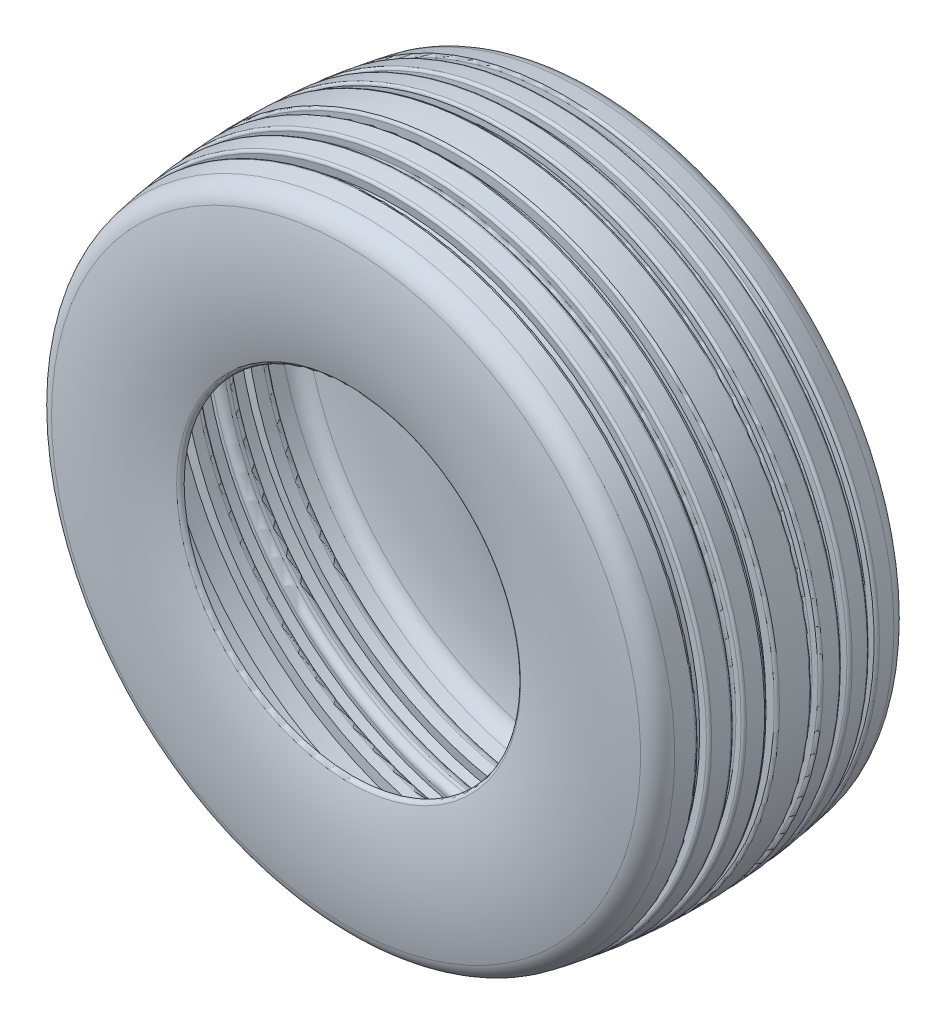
ISO-10303-21;
HEADER;
FILE_DESCRIPTION(('STEP AP214'),'2;1');
FILE_NAME('part.step','',(''),(''),'','','');
FILE_SCHEMA(('AUTOMOTIVE_DESIGN { 1 0 10303 214 1 1 1 1 }'));
ENDSEC;
DATA;
#1=APPLICATION_CONTEXT('core data for automotive mechanical design processes');
#2=APPLICATION_PROTOCOL_DEFINITION('international standard','automotive_design',2000,#1);
#3=PRODUCT_CONTEXT('',#1,'mechanical');
#4=PRODUCT('Part','Part','',(#3));
#5=PRODUCT_RELATED_PRODUCT_CATEGORY('part','',(#4));
#6=PRODUCT_DEFINITION_FORMATION('','',#4);
#7=PRODUCT_DEFINITION_CONTEXT('part definition',#1,'design');
#8=PRODUCT_DEFINITION('design','',#6,#7);
#9=PRODUCT_DEFINITION_SHAPE('','',#8);
#10=(LENGTH_UNIT() NAMED_UNIT(*) SI_UNIT(.MILLI.,.METRE.));
#11=(NAMED_UNIT(*) PLANE_ANGLE_UNIT() SI_UNIT($,.RADIAN.));
#12=(NAMED_UNIT(*) SI_UNIT($,.STERADIAN.) SOLID_ANGLE_UNIT());
#13=UNCERTAINTY_MEASURE_WITH_UNIT(LENGTH_MEASURE(1.E-05),#10,'distance_accuracy_value','');
#14=(GEOMETRIC_REPRESENTATION_CONTEXT(3) GLOBAL_UNCERTAINTY_ASSIGNED_CONTEXT((#13)) GLOBAL_UNIT_ASSIGNED_CONTEXT((#10,
#11,#12)) REPRESENTATION_CONTEXT('',''));
#15=CARTESIAN_POINT('',(0.,0.,0.));
#16=DIRECTION('',(0.,0.,1.));
#17=DIRECTION('',(1.,0.,0.));
#18=AXIS2_PLACEMENT_3D('',#15,#16,#17);
#19=CARTESIAN_POINT('',(0.,0.,-2.22044604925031E-13));
#20=DIRECTION('',(0.,0.,1.));
#21=DIRECTION('',(1.,0.,0.));
#22=AXIS2_PLACEMENT_3D('',#19,#20,#21);
#23=DEGENERATE_TOROIDAL_SURFACE('',#22,591.666666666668,1321.66666666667,.F.);
#24=CARTESIAN_POINT('',(0.,0.,-34.1550544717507));
#25=DIRECTION('',(0.,0.,1.));
#26=DIRECTION('',(1.,0.,0.));
#27=AXIS2_PLACEMENT_3D('',#24,#25,#26);
#28=CIRCLE('',#27,729.558601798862);
#29=CARTESIAN_POINT('',(729.558601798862,0.,-34.1550544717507));
#30=VERTEX_POINT('',#29);
#31=EDGE_CURVE('E127',#30,#30,#28,.T.);
#32=ORIENTED_EDGE('',*,*,#31,.T.);
#33=EDGE_LOOP('',(#32));
#34=FACE_BOUND('',#33,.T.);
#35=CARTESIAN_POINT('',(0.,0.,34.1550544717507));
#36=DIRECTION('',(0.,0.,-1.));
#37=DIRECTION('',(-1.,0.,0.));
#38=AXIS2_PLACEMENT_3D('',#35,#36,#37);
#39=CIRCLE('',#38,729.558601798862);
#40=CARTESIAN_POINT('',(-729.558601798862,0.,34.1550544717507));
#41=VERTEX_POINT('',#40);
#42=EDGE_CURVE('E207',#41,#41,#39,.T.);
#43=ORIENTED_EDGE('',*,*,#42,.T.);
#44=EDGE_LOOP('',(#43));
#45=FACE_BOUND('',#44,.T.);
#46=ADVANCED_FACE('F43',(#34,#45),#23,.F.);
#47=CARTESIAN_POINT('',(0.,0.,-248.684948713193));
#48=DIRECTION('',(0.,0.,1.));
#49=DIRECTION('',(1.,0.,0.));
#50=AXIS2_PLACEMENT_3D('',#47,#48,#49);
#51=CIRCLE('',#50,706.392875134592);
#52=CARTESIAN_POINT('',(706.392875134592,0.,-248.684948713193));
#53=VERTEX_POINT('',#52);
#54=EDGE_CURVE('E71',#53,#53,#51,.T.);
#55=ORIENTED_EDGE('',*,*,#54,.T.);
#56=EDGE_LOOP('',(#55));
#57=FACE_BOUND('',#56,.T.);
#58=CARTESIAN_POINT('',(0.,0.,-208.602384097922));
#59=DIRECTION('',(0.,0.,1.));
#60=DIRECTION('',(1.,0.,0.));
#61=AXIS2_PLACEMENT_3D('',#58,#59,#60);
#62=CIRCLE('',#61,713.43402796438);
#63=CARTESIAN_POINT('',(713.43402796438,0.,-208.602384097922));
#64=VERTEX_POINT('',#63);
#65=EDGE_CURVE('E99',#64,#64,#62,.F.);
#66=ORIENTED_EDGE('',*,*,#65,.T.);
#67=EDGE_LOOP('',(#66));
#68=FACE_BOUND('',#67,.T.);
#69=ADVANCED_FACE('F427',(#57,#68),#23,.F.);
#70=CARTESIAN_POINT('',(0.,0.,248.684948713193));
#71=DIRECTION('',(0.,0.,-1.));
#72=DIRECTION('',(-1.,0.,0.));
#73=AXIS2_PLACEMENT_3D('',#70,#71,#72);
#74=CIRCLE('',#73,706.392875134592);
#75=CARTESIAN_POINT('',(-706.392875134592,0.,248.684948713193));
#76=VERTEX_POINT('',#75);
#77=EDGE_CURVE('E56',#76,#76,#74,.T.);
#78=ORIENTED_EDGE('',*,*,#77,.T.);
#79=EDGE_LOOP('',(#78));
#80=FACE_BOUND('',#79,.T.);
#81=CARTESIAN_POINT('',(0.,0.,208.602384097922));
#82=DIRECTION('',(0.,0.,-1.));
#83=DIRECTION('',(-1.,0.,0.));
#84=AXIS2_PLACEMENT_3D('',#81,#82,#83);
#85=CIRCLE('',#84,713.43402796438);
#86=CARTESIAN_POINT('',(-713.43402796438,0.,208.602384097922));
#87=VERTEX_POINT('',#86);
#88=EDGE_CURVE('E179',#87,#87,#85,.F.);
#89=ORIENTED_EDGE('',*,*,#88,.T.);
#90=EDGE_LOOP('',(#89));
#91=FACE_BOUND('',#90,.T.);
#92=ADVANCED_FACE('F431',(#80,#91),#23,.F.);
#93=CARTESIAN_POINT('',(0.,0.,-277.914186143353));
#94=DIRECTION('',(0.,0.,1.));
#95=DIRECTION('',(1.,0.,0.));
#96=AXIS2_PLACEMENT_3D('',#93,#94,#95);
#97=DEGENERATE_TOROIDAL_SURFACE('',#96,541.47,580.,.T.);
#98=CARTESIAN_POINT('',(0.,0.,282.048288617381));
#99=DIRECTION('',(0.,0.,-1.));
#100=DIRECTION('',(-1.,0.,0.));
#101=AXIS2_PLACEMENT_3D('',#98,#99,#100);
#102=CIRCLE('',#101,390.334210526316);
#103=CARTESIAN_POINT('',(-390.334210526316,0.,282.048288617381));
#104=VERTEX_POINT('',#103);
#105=EDGE_CURVE('E51',#104,#104,#102,.T.);
#106=ORIENTED_EDGE('',*,*,#105,.T.);
#107=EDGE_LOOP('',(#106));
#108=FACE_BOUND('',#107,.T.);
#109=CARTESIAN_POINT('',(0.,0.,288.068559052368));
#110=DIRECTION('',(0.,0.,-1.));
#111=DIRECTION('',(-1.,0.,0.));
#112=AXIS2_PLACEMENT_3D('',#109,#110,#111);
#113=CIRCLE('',#112,668.211990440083);
#114=CARTESIAN_POINT('',(-668.211990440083,0.,288.068559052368));
#115=VERTEX_POINT('',#114);
#116=EDGE_CURVE('E61',#115,#115,#113,.F.);
#117=ORIENTED_EDGE('',*,*,#116,.T.);
#118=EDGE_LOOP('',(#117));
#119=FACE_BOUND('',#118,.T.);
#120=ADVANCED_FACE('F448',(#108,#119),#97,.T.);
#121=CARTESIAN_POINT('',(0.,0.,277.914186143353));
#122=DIRECTION('',(0.,0.,1.));
#123=DIRECTION('',(1.,0.,0.));
#124=AXIS2_PLACEMENT_3D('',#121,#122,#123);
#125=DEGENERATE_TOROIDAL_SURFACE('',#124,541.47,580.,.T.);
#126=CARTESIAN_POINT('',(0.,0.,-282.048288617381));
#127=DIRECTION('',(0.,0.,1.));
#128=DIRECTION('',(1.,0.,0.));
#129=AXIS2_PLACEMENT_3D('',#126,#127,#128);
#130=CIRCLE('',#129,390.334210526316);
#131=CARTESIAN_POINT('',(390.334210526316,0.,-282.048288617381));
#132=VERTEX_POINT('',#131);
#133=EDGE_CURVE('E10',#132,#132,#130,.T.);
#134=ORIENTED_EDGE('',*,*,#133,.T.);
#135=EDGE_LOOP('',(#134));
#136=FACE_BOUND('',#135,.T.);
#137=CARTESIAN_POINT('',(0.,0.,-288.068559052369));
#138=DIRECTION('',(0.,0.,1.));
#139=DIRECTION('',(1.,0.,0.));
#140=AXIS2_PLACEMENT_3D('',#137,#138,#139);
#141=CIRCLE('',#140,668.211990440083);
#142=CARTESIAN_POINT('',(668.211990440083,0.,-288.068559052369));
#143=VERTEX_POINT('',#142);
#144=EDGE_CURVE('E67',#143,#143,#141,.F.);
#145=ORIENTED_EDGE('',*,*,#144,.T.);
#146=EDGE_LOOP('',(#145));
#147=FACE_BOUND('',#146,.T.);
#148=ADVANCED_FACE('F455',(#136,#147),#125,.T.);
#149=CARTESIAN_POINT('',(0.,0.,179.190431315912));
#150=DIRECTION('',(0.,0.,1.));
#151=DIRECTION('',(1.,0.,0.));
#152=AXIS2_PLACEMENT_3D('',#149,#150,#151);
#153=CONICAL_SURFACE('',#152,693.579528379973,1.43226820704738);
#154=CARTESIAN_POINT('',(0.,0.,181.672579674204));
#155=DIRECTION('',(0.,0.,1.));
#156=DIRECTION('',(1.,0.,0.));
#157=AXIS2_PLACEMENT_3D('',#154,#155,#156);
#158=CIRCLE('',#157,711.382776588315);
#159=CARTESIAN_POINT('',(711.382776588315,0.,181.672579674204));
#160=VERTEX_POINT('',#159);
#161=EDGE_CURVE('E187',#160,#160,#158,.T.);
#162=ORIENTED_EDGE('',*,*,#161,.T.);
#163=EDGE_LOOP('',(#162));
#164=FACE_BOUND('',#163,.T.);
#165=CARTESIAN_POINT('',(0.,0.,179.190431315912));
#166=DIRECTION('',(0.,0.,1.));
#167=DIRECTION('',(1.,0.,0.));
#168=AXIS2_PLACEMENT_3D('',#165,#166,#167);
#169=CIRCLE('',#168,693.579528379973);
#170=CARTESIAN_POINT('',(693.579528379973,0.,179.190431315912));
#171=VERTEX_POINT('',#170);
#172=EDGE_CURVE('E236',#171,#171,#169,.T.);
#173=ORIENTED_EDGE('',*,*,#172,.F.);
#174=EDGE_LOOP('',(#173));
#175=FACE_BOUND('',#174,.T.);
#176=ADVANCED_FACE('F594',(#164,#175),#153,.F.);
#177=CARTESIAN_POINT('',(0.,0.,202.890613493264));
#178=DIRECTION('',(0.,0.,1.));
#179=DIRECTION('',(1.,0.,0.));
#180=AXIS2_PLACEMENT_3D('',#177,#178,#179);
#181=CONICAL_SURFACE('',#180,715.932800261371,1.41686118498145);
#182=CARTESIAN_POINT('',(0.,0.,199.888047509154));
#183=DIRECTION('',(0.,0.,1.));
#184=DIRECTION('',(1.,0.,0.));
#185=AXIS2_PLACEMENT_3D('',#182,#183,#184);
#186=CIRCLE('',#185,696.581714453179);
#187=CARTESIAN_POINT('',(696.581714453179,0.,199.888047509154));
#188=VERTEX_POINT('',#187);
#189=EDGE_CURVE('E167',#188,#188,#186,.T.);
#190=ORIENTED_EDGE('',*,*,#189,.T.);
#191=EDGE_LOOP('',(#190));
#192=FACE_BOUND('',#191,.T.);
#193=CARTESIAN_POINT('',(0.,0.,201.726334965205));
#194=DIRECTION('',(0.,0.,1.));
#195=DIRECTION('',(1.,0.,0.));
#196=AXIS2_PLACEMENT_3D('',#193,#194,#195);
#197=CIRCLE('',#196,708.429200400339);
#198=CARTESIAN_POINT('',(708.429200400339,0.,201.726334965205));
#199=VERTEX_POINT('',#198);
#200=EDGE_CURVE('E183',#199,#199,#197,.F.);
#201=ORIENTED_EDGE('',*,*,#200,.T.);
#202=EDGE_LOOP('',(#201));
#203=FACE_BOUND('',#202,.T.);
#204=ADVANCED_FACE('F470',(#192,#203),#181,.T.);
#205=CARTESIAN_POINT('',(0.,0.,-2.43972730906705E-07));
#206=DIRECTION('',(0.,0.,1.));
#207=DIRECTION('',(1.,0.,0.));
#208=AXIS2_PLACEMENT_3D('',#205,#206,#207);
#209=DEGENERATE_TOROIDAL_SURFACE('',#208,591.666665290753,1297.67753664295,.F.);
#210=CARTESIAN_POINT('',(0.,0.,193.066325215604));
#211=DIRECTION('',(0.,0.,-1.));
#212=DIRECTION('',(-1.,0.,0.));
#213=AXIS2_PLACEMENT_3D('',#210,#211,#212);
#214=CIRCLE('',#213,691.568458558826);
#215=CARTESIAN_POINT('',(-691.568458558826,0.,193.066325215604));
#216=VERTEX_POINT('',#215);
#217=EDGE_CURVE('E163',#216,#216,#214,.T.);
#218=ORIENTED_EDGE('',*,*,#217,.T.);
#219=EDGE_LOOP('',(#218));
#220=FACE_BOUND('',#219,.T.);
#221=ORIENTED_EDGE('',*,*,#172,.T.);
#222=EDGE_LOOP('',(#221));
#223=FACE_BOUND('',#222,.T.);
#224=ADVANCED_FACE('F459',(#220,#223),#209,.F.);
#225=CARTESIAN_POINT('',(0.,0.,137.668702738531));
#226=DIRECTION('',(0.,0.,-1.));
#227=DIRECTION('',(-1.,0.,0.));
#228=AXIS2_PLACEMENT_3D('',#225,#226,#227);
#229=CIRCLE('',#228,722.81045601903);
#230=CARTESIAN_POINT('',(-722.81045601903,0.,137.668702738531));
#231=VERTEX_POINT('',#230);
#232=EDGE_CURVE('E191',#231,#231,#229,.F.);
#233=ORIENTED_EDGE('',*,*,#232,.T.);
#234=EDGE_LOOP('',(#233));
#235=FACE_BOUND('',#234,.T.);
#236=CARTESIAN_POINT('',(0.,0.,176.531461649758));
#237=DIRECTION('',(0.,0.,-1.));
#238=DIRECTION('',(-1.,0.,0.));
#239=AXIS2_PLACEMENT_3D('',#236,#237,#238);
#240=CIRCLE('',#239,718.157527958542);
#241=CARTESIAN_POINT('',(-718.157527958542,0.,176.531461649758));
#242=VERTEX_POINT('',#241);
#243=EDGE_CURVE('E195',#242,#242,#240,.T.);
#244=ORIENTED_EDGE('',*,*,#243,.T.);
#245=EDGE_LOOP('',(#244));
#246=FACE_BOUND('',#245,.T.);
#247=ADVANCED_FACE('F450',(#235,#246),#23,.F.);
#248=CARTESIAN_POINT('',(0.,0.,131.892551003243));
#249=DIRECTION('',(0.,0.,1.));
#250=DIRECTION('',(1.,0.,0.));
#251=AXIS2_PLACEMENT_3D('',#248,#249,#250);
#252=CONICAL_SURFACE('',#251,725.620434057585,1.47100452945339);
#253=CARTESIAN_POINT('',(0.,0.,129.786812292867));
#254=DIRECTION('',(0.,0.,1.));
#255=DIRECTION('',(1.,0.,0.));
#256=AXIS2_PLACEMENT_3D('',#253,#254,#255);
#257=CIRCLE('',#256,704.589205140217);
#258=CARTESIAN_POINT('',(704.589205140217,0.,129.786812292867));
#259=VERTEX_POINT('',#258);
#260=EDGE_CURVE('E159',#259,#259,#257,.T.);
#261=ORIENTED_EDGE('',*,*,#260,.T.);
#262=EDGE_LOOP('',(#261));
#263=FACE_BOUND('',#262,.T.);
#264=CARTESIAN_POINT('',(0.,0.,131.073575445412));
#265=DIRECTION('',(0.,0.,1.));
#266=DIRECTION('',(1.,0.,0.));
#267=AXIS2_PLACEMENT_3D('',#264,#265,#266);
#268=CIRCLE('',#267,717.440852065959);
#269=CARTESIAN_POINT('',(717.440852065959,0.,131.073575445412));
#270=VERTEX_POINT('',#269);
#271=EDGE_CURVE('E199',#270,#270,#268,.F.);
#272=ORIENTED_EDGE('',*,*,#271,.T.);
#273=EDGE_LOOP('',(#272));
#274=FACE_BOUND('',#273,.T.);
#275=ADVANCED_FACE('F458',(#263,#274),#252,.T.);
#276=CARTESIAN_POINT('',(0.,0.,109.427116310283));
#277=DIRECTION('',(0.,0.,1.));
#278=DIRECTION('',(1.,0.,0.));
#279=AXIS2_PLACEMENT_3D('',#276,#277,#278);
#280=CONICAL_SURFACE('',#279,700.458945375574,1.48631024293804);
#281=CARTESIAN_POINT('',(0.,0.,111.022180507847));
#282=DIRECTION('',(0.,0.,1.));
#283=DIRECTION('',(1.,0.,0.));
#284=AXIS2_PLACEMENT_3D('',#281,#282,#283);
#285=CIRCLE('',#284,719.2936123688);
#286=CARTESIAN_POINT('',(719.2936123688,0.,111.022180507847));
#287=VERTEX_POINT('',#286);
#288=EDGE_CURVE('E227',#287,#287,#285,.T.);
#289=ORIENTED_EDGE('',*,*,#288,.T.);
#290=EDGE_LOOP('',(#289));
#291=FACE_BOUND('',#290,.T.);
#292=CARTESIAN_POINT('',(0.,0.,109.932264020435));
#293=DIRECTION('',(0.,0.,1.));
#294=DIRECTION('',(1.,0.,0.));
#295=AXIS2_PLACEMENT_3D('',#292,#293,#294);
#296=CIRCLE('',#295,706.423776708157);
#297=CARTESIAN_POINT('',(706.423776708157,0.,109.932264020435));
#298=VERTEX_POINT('',#297);
#299=EDGE_CURVE('E231',#298,#298,#296,.F.);
#300=ORIENTED_EDGE('',*,*,#299,.T.);
#301=EDGE_LOOP('',(#300));
#302=FACE_BOUND('',#301,.T.);
#303=ADVANCED_FACE('F466',(#291,#302),#280,.F.);
#304=CARTESIAN_POINT('',(0.,0.,-2.43972730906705E-07));
#305=DIRECTION('',(0.,0.,1.));
#306=DIRECTION('',(1.,0.,0.));
#307=AXIS2_PLACEMENT_3D('',#304,#305,#306);
#308=DEGENERATE_TOROIDAL_SURFACE('',#307,591.666665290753,1296.75089650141,.F.);
#309=CARTESIAN_POINT('',(0.,0.,123.24640789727));
#310=DIRECTION('',(0.,0.,-1.));
#311=DIRECTION('',(-1.,0.,0.));
#312=AXIS2_PLACEMENT_3D('',#309,#310,#311);
#313=CIRCLE('',#312,699.214123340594);
#314=CARTESIAN_POINT('',(-699.214123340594,0.,123.24640789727));
#315=VERTEX_POINT('',#314);
#316=EDGE_CURVE('E155',#315,#315,#313,.T.);
#317=ORIENTED_EDGE('',*,*,#316,.T.);
#318=EDGE_LOOP('',(#317));
#319=FACE_BOUND('',#318,.T.);
#320=CARTESIAN_POINT('',(0.,0.,115.377019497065));
#321=DIRECTION('',(0.,0.,-1.));
#322=DIRECTION('',(-1.,0.,0.));
#323=AXIS2_PLACEMENT_3D('',#320,#321,#322);
#324=CIRCLE('',#323,699.941259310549);
#325=CARTESIAN_POINT('',(-699.941259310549,0.,115.377019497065));
#326=VERTEX_POINT('',#325);
#327=EDGE_CURVE('E215',#326,#326,#324,.F.);
#328=ORIENTED_EDGE('',*,*,#327,.T.);
#329=EDGE_LOOP('',(#328));
#330=FACE_BOUND('',#329,.T.);
#331=ADVANCED_FACE('F1024',(#319,#330),#308,.F.);
#332=CARTESIAN_POINT('',(0.,704.382879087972,40.));
#333=DIRECTION('',(0.,0.,1.));
#334=DIRECTION('',(1.,0.,0.));
#335=AXIS2_PLACEMENT_3D('',#332,#333,#334);
#336=PLANE('',#335);
#337=CARTESIAN_POINT('',(0.,0.,40.));
#338=DIRECTION('',(0.,0.,1.));
#339=DIRECTION('',(1.,0.,0.));
#340=AXIS2_PLACEMENT_3D('',#337,#338,#339);
#341=CIRCLE('',#340,723.56060562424);
#342=CARTESIAN_POINT('',(723.56060562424,0.,40.));
#343=VERTEX_POINT('',#342);
#344=EDGE_CURVE('E211',#343,#343,#341,.T.);
#345=ORIENTED_EDGE('',*,*,#344,.T.);
#346=EDGE_LOOP('',(#345));
#347=FACE_BOUND('',#346,.T.);
#348=CARTESIAN_POINT('',(0.,0.,40.));
#349=DIRECTION('',(0.,0.,1.));
#350=DIRECTION('',(1.,0.,0.));
#351=AXIS2_PLACEMENT_3D('',#348,#349,#350);
#352=CIRCLE('',#351,704.382879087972);
#353=CARTESIAN_POINT('',(704.382879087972,0.,40.));
#354=VERTEX_POINT('',#353);
#355=EDGE_CURVE('E235',#354,#354,#352,.T.);
#356=ORIENTED_EDGE('',*,*,#355,.F.);
#357=EDGE_LOOP('',(#356));
#358=FACE_BOUND('',#357,.T.);
#359=ADVANCED_FACE('F1022',(#347,#358),#336,.T.);
#360=CARTESIAN_POINT('',(0.,0.,-2.43972730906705E-07));
#361=DIRECTION('',(0.,0.,1.));
#362=DIRECTION('',(1.,0.,0.));
#363=AXIS2_PLACEMENT_3D('',#360,#361,#362);
#364=DEGENERATE_TOROIDAL_SURFACE('',#363,591.666665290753,1296.66665782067,.F.);
#365=CARTESIAN_POINT('',(0.,0.,53.4603971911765));
#366=DIRECTION('',(0.,0.,-1.));
#367=DIRECTION('',(-1.,0.,0.));
#368=AXIS2_PLACEMENT_3D('',#365,#366,#367);
#369=CIRCLE('',#368,703.897461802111);
#370=CARTESIAN_POINT('',(-703.897461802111,0.,53.4603971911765));
#371=VERTEX_POINT('',#370);
#372=EDGE_CURVE('E171',#371,#371,#369,.T.);
#373=ORIENTED_EDGE('',*,*,#372,.T.);
#374=EDGE_LOOP('',(#373));
#375=FACE_BOUND('',#374,.T.);
#376=ORIENTED_EDGE('',*,*,#355,.T.);
#377=EDGE_LOOP('',(#376));
#378=FACE_BOUND('',#377,.T.);
#379=ADVANCED_FACE('F486',(#375,#378),#364,.F.);
#380=CARTESIAN_POINT('',(0.,0.,60.5728836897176));
#381=DIRECTION('',(0.,0.,1.));
#382=DIRECTION('',(1.,0.,0.));
#383=AXIS2_PLACEMENT_3D('',#380,#381,#382);
#384=CONICAL_SURFACE('',#383,728.611222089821,1.52494958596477);
#385=CARTESIAN_POINT('',(0.,0.,59.7014671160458));
#386=DIRECTION('',(0.,0.,1.));
#387=DIRECTION('',(1.,0.,0.));
#388=AXIS2_PLACEMENT_3D('',#385,#386,#387);
#389=CIRCLE('',#388,709.617376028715);
#390=CARTESIAN_POINT('',(709.617376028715,0.,59.7014671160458));
#391=VERTEX_POINT('',#390);
#392=EDGE_CURVE('E175',#391,#391,#389,.T.);
#393=ORIENTED_EDGE('',*,*,#392,.T.);
#394=EDGE_LOOP('',(#393));
#395=FACE_BOUND('',#394,.T.);
#396=CARTESIAN_POINT('',(0.,0.,60.2972725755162));
#397=DIRECTION('',(0.,0.,1.));
#398=DIRECTION('',(1.,0.,0.));
#399=AXIS2_PLACEMENT_3D('',#396,#397,#398);
#400=CIRCLE('',#399,722.603859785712);
#401=CARTESIAN_POINT('',(722.603859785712,0.,60.2972725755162));
#402=VERTEX_POINT('',#401);
#403=EDGE_CURVE('E203',#402,#402,#400,.F.);
#404=ORIENTED_EDGE('',*,*,#403,.T.);
#405=EDGE_LOOP('',(#404));
#406=FACE_BOUND('',#405,.T.);
#407=ADVANCED_FACE('F476',(#395,#406),#384,.T.);
#408=CARTESIAN_POINT('',(0.,0.,105.522624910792));
#409=DIRECTION('',(0.,0.,-1.));
#410=DIRECTION('',(-1.,0.,0.));
#411=AXIS2_PLACEMENT_3D('',#408,#409,#410);
#412=CIRCLE('',#411,725.780771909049);
#413=CARTESIAN_POINT('',(-725.780771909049,0.,105.522624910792));
#414=VERTEX_POINT('',#413);
#415=EDGE_CURVE('E219',#414,#414,#412,.T.);
#416=ORIENTED_EDGE('',*,*,#415,.T.);
#417=EDGE_LOOP('',(#416));
#418=FACE_BOUND('',#417,.T.);
#419=CARTESIAN_POINT('',(0.,0.,66.5932829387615));
#420=DIRECTION('',(0.,0.,-1.));
#421=DIRECTION('',(-1.,0.,0.));
#422=AXIS2_PLACEMENT_3D('',#419,#420,#421);
#423=CIRCLE('',#422,728.321254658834);
#424=CARTESIAN_POINT('',(-728.321254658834,0.,66.5932829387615));
#425=VERTEX_POINT('',#424);
#426=EDGE_CURVE('E223',#425,#425,#423,.F.);
#427=ORIENTED_EDGE('',*,*,#426,.T.);
#428=EDGE_LOOP('',(#427));
#429=FACE_BOUND('',#428,.T.);
#430=ADVANCED_FACE('F438',(#418,#429),#23,.F.);
#431=CARTESIAN_POINT('',(0.,0.,105.043581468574));
#432=DIRECTION('',(0.,0.,-1.));
#433=DIRECTION('',(-1.,0.,0.));
#434=AXIS2_PLACEMENT_3D('',#431,#432,#433);
#435=TOROIDAL_SURFACE('',#434,719.799926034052,6.);
#436=ORIENTED_EDGE('',*,*,#415,.F.);
#437=EDGE_LOOP('',(#436));
#438=FACE_BOUND('',#437,.T.);
#439=ORIENTED_EDGE('',*,*,#288,.F.);
#440=EDGE_LOOP('',(#439));
#441=FACE_BOUND('',#440,.T.);
#442=ADVANCED_FACE('F475',(#438,#441),#435,.T.);
#443=CARTESIAN_POINT('',(0.,0.,115.910863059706));
#444=DIRECTION('',(0.,0.,1.));
#445=DIRECTION('',(1.,0.,0.));
#446=AXIS2_PLACEMENT_3D('',#443,#444,#445);
#447=TOROIDAL_SURFACE('',#446,705.917463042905,6.);
#448=ORIENTED_EDGE('',*,*,#299,.F.);
#449=EDGE_LOOP('',(#448));
#450=FACE_BOUND('',#449,.T.);
#451=ORIENTED_EDGE('',*,*,#327,.F.);
#452=EDGE_LOOP('',(#451));
#453=FACE_BOUND('',#452,.T.);
#454=ADVANCED_FACE('F482',(#450,#453),#447,.F.);
#455=CARTESIAN_POINT('',(0.,0.,34.));
#456=DIRECTION('',(0.,0.,1.));
#457=DIRECTION('',(1.,0.,0.));
#458=AXIS2_PLACEMENT_3D('',#455,#456,#457);
#459=TOROIDAL_SURFACE('',#458,723.56060562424,6.);
#460=ORIENTED_EDGE('',*,*,#42,.F.);
#461=EDGE_LOOP('',(#460));
#462=FACE_BOUND('',#461,.T.);
#463=ORIENTED_EDGE('',*,*,#344,.F.);
#464=EDGE_LOOP('',(#463));
#465=FACE_BOUND('',#464,.T.);
#466=ADVANCED_FACE('F496',(#462,#465),#459,.T.);
#467=CARTESIAN_POINT('',(0.,0.,66.2909679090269));
#468=DIRECTION('',(0.,0.,-1.));
#469=DIRECTION('',(-1.,0.,0.));
#470=AXIS2_PLACEMENT_3D('',#467,#468,#469);
#471=TOROIDAL_SURFACE('',#470,722.328875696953,6.);
#472=ORIENTED_EDGE('',*,*,#403,.F.);
#473=EDGE_LOOP('',(#472));
#474=FACE_BOUND('',#473,.T.);
#475=ORIENTED_EDGE('',*,*,#426,.F.);
#476=EDGE_LOOP('',(#475));
#477=FACE_BOUND('',#476,.T.);
#478=ADVANCED_FACE('F493',(#474,#477),#471,.T.);
#479=CARTESIAN_POINT('',(0.,0.,137.043725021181));
#480=DIRECTION('',(0.,0.,1.));
#481=DIRECTION('',(1.,0.,0.));
#482=AXIS2_PLACEMENT_3D('',#479,#480,#481);
#483=TOROIDAL_SURFACE('',#482,716.843094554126,6.);
#484=ORIENTED_EDGE('',*,*,#232,.F.);
#485=EDGE_LOOP('',(#484));
#486=FACE_BOUND('',#485,.T.);
#487=ORIENTED_EDGE('',*,*,#271,.F.);
#488=EDGE_LOOP('',(#487));
#489=FACE_BOUND('',#488,.T.);
#490=ADVANCED_FACE('F495',(#486,#489),#483,.T.);
#491=CARTESIAN_POINT('',(0.,0.,175.730057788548));
#492=DIRECTION('',(0.,0.,-1.));
#493=DIRECTION('',(-1.,0.,0.));
#494=AXIS2_PLACEMENT_3D('',#491,#492,#493);
#495=TOROIDAL_SURFACE('',#494,712.211289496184,6.);
#496=ORIENTED_EDGE('',*,*,#243,.F.);
#497=EDGE_LOOP('',(#496));
#498=FACE_BOUND('',#497,.T.);
#499=ORIENTED_EDGE('',*,*,#161,.F.);
#500=EDGE_LOOP('',(#499));
#501=FACE_BOUND('',#500,.T.);
#502=ADVANCED_FACE('F503',(#498,#501),#495,.T.);
#503=CARTESIAN_POINT('',(0.,0.,207.655387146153));
#504=DIRECTION('',(0.,0.,1.));
#505=DIRECTION('',(1.,0.,0.));
#506=AXIS2_PLACEMENT_3D('',#503,#504,#505);
#507=TOROIDAL_SURFACE('',#506,707.509232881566,6.);
#508=ORIENTED_EDGE('',*,*,#88,.F.);
#509=EDGE_LOOP('',(#508));
#510=FACE_BOUND('',#509,.T.);
#511=ORIENTED_EDGE('',*,*,#200,.F.);
#512=EDGE_LOOP('',(#511));
#513=FACE_BOUND('',#512,.T.);
#514=ADVANCED_FACE('F513',(#510,#513),#507,.T.);
#515=CARTESIAN_POINT('',(0.,0.,53.7077717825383));
#516=DIRECTION('',(0.,0.,1.));
#517=DIRECTION('',(1.,0.,0.));
#518=AXIS2_PLACEMENT_3D('',#515,#516,#517);
#519=TOROIDAL_SURFACE('',#518,709.892360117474,6.);
#520=ORIENTED_EDGE('',*,*,#372,.F.);
#521=EDGE_LOOP('',(#520));
#522=FACE_BOUND('',#521,.T.);
#523=ORIENTED_EDGE('',*,*,#392,.F.);
#524=EDGE_LOOP('',(#523));
#525=FACE_BOUND('',#524,.T.);
#526=ADVANCED_FACE('F517',(#522,#525),#519,.F.);
#527=CARTESIAN_POINT('',(0.,0.,193.958995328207));
#528=DIRECTION('',(0.,0.,1.));
#529=DIRECTION('',(1.,0.,0.));
#530=AXIS2_PLACEMENT_3D('',#527,#528,#529);
#531=TOROIDAL_SURFACE('',#530,697.501681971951,6.);
#532=ORIENTED_EDGE('',*,*,#217,.F.);
#533=EDGE_LOOP('',(#532));
#534=FACE_BOUND('',#533,.T.);
#535=ORIENTED_EDGE('',*,*,#189,.F.);
#536=EDGE_LOOP('',(#535));
#537=FACE_BOUND('',#536,.T.);
#538=ADVANCED_FACE('F521',(#534,#537),#531,.F.);
#539=CARTESIAN_POINT('',(0.,0.,123.816662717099));
#540=DIRECTION('',(0.,0.,1.));
#541=DIRECTION('',(1.,0.,0.));
#542=AXIS2_PLACEMENT_3D('',#539,#540,#541);
#543=TOROIDAL_SURFACE('',#542,705.186962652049,6.);
#544=ORIENTED_EDGE('',*,*,#316,.F.);
#545=EDGE_LOOP('',(#544));
#546=FACE_BOUND('',#545,.T.);
#547=ORIENTED_EDGE('',*,*,#260,.F.);
#548=EDGE_LOOP('',(#547));
#549=FACE_BOUND('',#548,.T.);
#550=ADVANCED_FACE('F525',(#546,#549),#543,.F.);
#551=CARTESIAN_POINT('',(0.,0.,-179.190431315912));
#552=DIRECTION('',(0.,0.,-1.));
#553=DIRECTION('',(1.,0.,0.));
#554=AXIS2_PLACEMENT_3D('',#551,#552,#553);
#555=CONICAL_SURFACE('',#554,693.579528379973,1.43226820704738);
#556=CARTESIAN_POINT('',(0.,0.,-181.672579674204));
#557=DIRECTION('',(0.,0.,-1.));
#558=DIRECTION('',(-1.,0.,0.));
#559=AXIS2_PLACEMENT_3D('',#556,#557,#558);
#560=CIRCLE('',#559,711.382776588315);
#561=CARTESIAN_POINT('',(-711.382776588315,0.,-181.672579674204));
#562=VERTEX_POINT('',#561);
#563=EDGE_CURVE('E107',#562,#562,#560,.T.);
#564=ORIENTED_EDGE('',*,*,#563,.T.);
#565=EDGE_LOOP('',(#564));
#566=FACE_BOUND('',#565,.T.);
#567=CARTESIAN_POINT('',(0.,0.,-179.190431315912));
#568=DIRECTION('',(0.,0.,1.));
#569=DIRECTION('',(1.,0.,0.));
#570=AXIS2_PLACEMENT_3D('',#567,#568,#569);
#571=CIRCLE('',#570,693.579528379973);
#572=CARTESIAN_POINT('',(693.579528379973,0.,-179.190431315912));
#573=VERTEX_POINT('',#572);
#574=EDGE_CURVE('E244',#573,#573,#571,.T.);
#575=ORIENTED_EDGE('',*,*,#574,.T.);
#576=EDGE_LOOP('',(#575));
#577=FACE_BOUND('',#576,.T.);
#578=ADVANCED_FACE('F528',(#566,#577),#555,.F.);
#579=CARTESIAN_POINT('',(0.,0.,-202.890613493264));
#580=DIRECTION('',(0.,0.,-1.));
#581=DIRECTION('',(1.,0.,0.));
#582=AXIS2_PLACEMENT_3D('',#579,#580,#581);
#583=CONICAL_SURFACE('',#582,715.932800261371,1.41686118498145);
#584=CARTESIAN_POINT('',(0.,0.,-199.888047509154));
#585=DIRECTION('',(0.,0.,-1.));
#586=DIRECTION('',(-1.,0.,0.));
#587=AXIS2_PLACEMENT_3D('',#584,#585,#586);
#588=CIRCLE('',#587,696.581714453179);
#589=CARTESIAN_POINT('',(-696.581714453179,0.,-199.888047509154));
#590=VERTEX_POINT('',#589);
#591=EDGE_CURVE('E83',#590,#590,#588,.T.);
#592=ORIENTED_EDGE('',*,*,#591,.T.);
#593=EDGE_LOOP('',(#592));
#594=FACE_BOUND('',#593,.T.);
#595=CARTESIAN_POINT('',(0.,0.,-201.726334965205));
#596=DIRECTION('',(0.,0.,-1.));
#597=DIRECTION('',(-1.,0.,0.));
#598=AXIS2_PLACEMENT_3D('',#595,#596,#597);
#599=CIRCLE('',#598,708.429200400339);
#600=CARTESIAN_POINT('',(-708.429200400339,0.,-201.726334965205));
#601=VERTEX_POINT('',#600);
#602=EDGE_CURVE('E103',#601,#601,#599,.F.);
#603=ORIENTED_EDGE('',*,*,#602,.T.);
#604=EDGE_LOOP('',(#603));
#605=FACE_BOUND('',#604,.T.);
#606=ADVANCED_FACE('F1012',(#594,#605),#583,.T.);
#607=CARTESIAN_POINT('',(0.,0.,2.43972730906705E-07));
#608=DIRECTION('',(0.,0.,-1.));
#609=DIRECTION('',(1.,0.,0.));
#610=AXIS2_PLACEMENT_3D('',#607,#608,#609);
#611=DEGENERATE_TOROIDAL_SURFACE('',#610,591.666665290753,1297.67753664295,.F.);
#612=CARTESIAN_POINT('',(0.,0.,-193.066325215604));
#613=DIRECTION('',(0.,0.,1.));
#614=DIRECTION('',(1.,0.,0.));
#615=AXIS2_PLACEMENT_3D('',#612,#613,#614);
#616=CIRCLE('',#615,691.568458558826);
#617=CARTESIAN_POINT('',(691.568458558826,0.,-193.066325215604));
#618=VERTEX_POINT('',#617);
#619=EDGE_CURVE('E87',#618,#618,#616,.T.);
#620=ORIENTED_EDGE('',*,*,#619,.T.);
#621=EDGE_LOOP('',(#620));
#622=FACE_BOUND('',#621,.T.);
#623=ORIENTED_EDGE('',*,*,#574,.F.);
#624=EDGE_LOOP('',(#623));
#625=FACE_BOUND('',#624,.T.);
#626=ADVANCED_FACE('F1015',(#622,#625),#611,.F.);
#627=CARTESIAN_POINT('',(0.,0.,-137.668702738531));
#628=DIRECTION('',(0.,0.,1.));
#629=DIRECTION('',(1.,0.,0.));
#630=AXIS2_PLACEMENT_3D('',#627,#628,#629);
#631=CIRCLE('',#630,722.81045601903);
#632=CARTESIAN_POINT('',(722.81045601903,0.,-137.668702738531));
#633=VERTEX_POINT('',#632);
#634=EDGE_CURVE('E111',#633,#633,#631,.F.);
#635=ORIENTED_EDGE('',*,*,#634,.T.);
#636=EDGE_LOOP('',(#635));
#637=FACE_BOUND('',#636,.T.);
#638=CARTESIAN_POINT('',(0.,0.,-176.531461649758));
#639=DIRECTION('',(0.,0.,1.));
#640=DIRECTION('',(1.,0.,0.));
#641=AXIS2_PLACEMENT_3D('',#638,#639,#640);
#642=CIRCLE('',#641,718.157527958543);
#643=CARTESIAN_POINT('',(718.157527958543,0.,-176.531461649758));
#644=VERTEX_POINT('',#643);
#645=EDGE_CURVE('E115',#644,#644,#642,.T.);
#646=ORIENTED_EDGE('',*,*,#645,.T.);
#647=EDGE_LOOP('',(#646));
#648=FACE_BOUND('',#647,.T.);
#649=ADVANCED_FACE('F439',(#637,#648),#23,.F.);
#650=CARTESIAN_POINT('',(0.,0.,-131.892551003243));
#651=DIRECTION('',(0.,0.,-1.));
#652=DIRECTION('',(1.,0.,0.));
#653=AXIS2_PLACEMENT_3D('',#650,#651,#652);
#654=CONICAL_SURFACE('',#653,725.620434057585,1.47100452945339);
#655=CARTESIAN_POINT('',(0.,0.,-129.786812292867));
#656=DIRECTION('',(0.,0.,-1.));
#657=DIRECTION('',(-1.,0.,0.));
#658=AXIS2_PLACEMENT_3D('',#655,#656,#657);
#659=CIRCLE('',#658,704.589205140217);
#660=CARTESIAN_POINT('',(-704.589205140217,0.,-129.786812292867));
#661=VERTEX_POINT('',#660);
#662=EDGE_CURVE('E75',#661,#661,#659,.T.);
#663=ORIENTED_EDGE('',*,*,#662,.T.);
#664=EDGE_LOOP('',(#663));
#665=FACE_BOUND('',#664,.T.);
#666=CARTESIAN_POINT('',(0.,0.,-131.073575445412));
#667=DIRECTION('',(0.,0.,-1.));
#668=DIRECTION('',(-1.,0.,0.));
#669=AXIS2_PLACEMENT_3D('',#666,#667,#668);
#670=CIRCLE('',#669,717.440852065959);
#671=CARTESIAN_POINT('',(-717.440852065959,0.,-131.073575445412));
#672=VERTEX_POINT('',#671);
#673=EDGE_CURVE('E119',#672,#672,#670,.F.);
#674=ORIENTED_EDGE('',*,*,#673,.T.);
#675=EDGE_LOOP('',(#674));
#676=FACE_BOUND('',#675,.T.);
#677=ADVANCED_FACE('F1004',(#665,#676),#654,.T.);
#678=CARTESIAN_POINT('',(0.,0.,-109.427116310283));
#679=DIRECTION('',(0.,0.,-1.));
#680=DIRECTION('',(1.,0.,0.));
#681=AXIS2_PLACEMENT_3D('',#678,#679,#680);
#682=CONICAL_SURFACE('',#681,700.458945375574,1.48631024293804);
#683=CARTESIAN_POINT('',(0.,0.,-111.022180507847));
#684=DIRECTION('',(0.,0.,-1.));
#685=DIRECTION('',(-1.,0.,0.));
#686=AXIS2_PLACEMENT_3D('',#683,#684,#685);
#687=CIRCLE('',#686,719.293612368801);
#688=CARTESIAN_POINT('',(-719.293612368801,0.,-111.022180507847));
#689=VERTEX_POINT('',#688);
#690=EDGE_CURVE('E147',#689,#689,#687,.T.);
#691=ORIENTED_EDGE('',*,*,#690,.T.);
#692=EDGE_LOOP('',(#691));
#693=FACE_BOUND('',#692,.T.);
#694=CARTESIAN_POINT('',(0.,0.,-109.932264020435));
#695=DIRECTION('',(0.,0.,-1.));
#696=DIRECTION('',(-1.,0.,0.));
#697=AXIS2_PLACEMENT_3D('',#694,#695,#696);
#698=CIRCLE('',#697,706.423776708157);
#699=CARTESIAN_POINT('',(-706.423776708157,0.,-109.932264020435));
#700=VERTEX_POINT('',#699);
#701=EDGE_CURVE('E151',#700,#700,#698,.F.);
#702=ORIENTED_EDGE('',*,*,#701,.T.);
#703=EDGE_LOOP('',(#702));
#704=FACE_BOUND('',#703,.T.);
#705=ADVANCED_FACE('F1001',(#693,#704),#682,.F.);
#706=CARTESIAN_POINT('',(0.,0.,2.43972730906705E-07));
#707=DIRECTION('',(0.,0.,-1.));
#708=DIRECTION('',(1.,0.,0.));
#709=AXIS2_PLACEMENT_3D('',#706,#707,#708);
#710=DEGENERATE_TOROIDAL_SURFACE('',#709,591.666665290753,1296.75089650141,.F.);
#711=CARTESIAN_POINT('',(0.,0.,-123.24640789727));
#712=DIRECTION('',(0.,0.,1.));
#713=DIRECTION('',(1.,0.,0.));
#714=AXIS2_PLACEMENT_3D('',#711,#712,#713);
#715=CIRCLE('',#714,699.214123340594);
#716=CARTESIAN_POINT('',(699.214123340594,0.,-123.24640789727));
#717=VERTEX_POINT('',#716);
#718=EDGE_CURVE('E79',#717,#717,#715,.T.);
#719=ORIENTED_EDGE('',*,*,#718,.T.);
#720=EDGE_LOOP('',(#719));
#721=FACE_BOUND('',#720,.T.);
#722=CARTESIAN_POINT('',(0.,0.,-115.377019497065));
#723=DIRECTION('',(0.,0.,1.));
#724=DIRECTION('',(1.,0.,0.));
#725=AXIS2_PLACEMENT_3D('',#722,#723,#724);
#726=CIRCLE('',#725,699.941259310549);
#727=CARTESIAN_POINT('',(699.941259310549,0.,-115.377019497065));
#728=VERTEX_POINT('',#727);
#729=EDGE_CURVE('E135',#728,#728,#726,.F.);
#730=ORIENTED_EDGE('',*,*,#729,.T.);
#731=EDGE_LOOP('',(#730));
#732=FACE_BOUND('',#731,.T.);
#733=ADVANCED_FACE('F996',(#721,#732),#710,.F.);
#734=CARTESIAN_POINT('',(0.,704.382879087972,-40.));
#735=DIRECTION('',(0.,0.,-1.));
#736=DIRECTION('',(1.,0.,0.));
#737=AXIS2_PLACEMENT_3D('',#734,#735,#736);
#738=PLANE('',#737);
#739=CARTESIAN_POINT('',(0.,0.,-40.));
#740=DIRECTION('',(0.,0.,-1.));
#741=DIRECTION('',(-1.,0.,0.));
#742=AXIS2_PLACEMENT_3D('',#739,#740,#741);
#743=CIRCLE('',#742,723.56060562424);
#744=CARTESIAN_POINT('',(-723.56060562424,0.,-40.));
#745=VERTEX_POINT('',#744);
#746=EDGE_CURVE('E131',#745,#745,#743,.T.);
#747=ORIENTED_EDGE('',*,*,#746,.T.);
#748=EDGE_LOOP('',(#747));
#749=FACE_BOUND('',#748,.T.);
#750=CARTESIAN_POINT('',(0.,0.,-40.));
#751=DIRECTION('',(0.,0.,1.));
#752=DIRECTION('',(1.,0.,0.));
#753=AXIS2_PLACEMENT_3D('',#750,#751,#752);
#754=CIRCLE('',#753,704.382879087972);
#755=CARTESIAN_POINT('',(704.382879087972,0.,-40.));
#756=VERTEX_POINT('',#755);
#757=EDGE_CURVE('E240',#756,#756,#754,.T.);
#758=ORIENTED_EDGE('',*,*,#757,.T.);
#759=EDGE_LOOP('',(#758));
#760=FACE_BOUND('',#759,.T.);
#761=ADVANCED_FACE('F993',(#749,#760),#738,.T.);
#762=CARTESIAN_POINT('',(0.,0.,2.43972730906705E-07));
#763=DIRECTION('',(0.,0.,-1.));
#764=DIRECTION('',(1.,0.,0.));
#765=AXIS2_PLACEMENT_3D('',#762,#763,#764);
#766=DEGENERATE_TOROIDAL_SURFACE('',#765,591.666665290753,1296.66665782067,.F.);
#767=CARTESIAN_POINT('',(0.,0.,-53.4603971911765));
#768=DIRECTION('',(0.,0.,1.));
#769=DIRECTION('',(1.,0.,0.));
#770=AXIS2_PLACEMENT_3D('',#767,#768,#769);
#771=CIRCLE('',#770,703.897461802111);
#772=CARTESIAN_POINT('',(703.897461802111,0.,-53.4603971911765));
#773=VERTEX_POINT('',#772);
#774=EDGE_CURVE('E95',#773,#773,#771,.T.);
#775=ORIENTED_EDGE('',*,*,#774,.T.);
#776=EDGE_LOOP('',(#775));
#777=FACE_BOUND('',#776,.T.);
#778=ORIENTED_EDGE('',*,*,#757,.F.);
#779=EDGE_LOOP('',(#778));
#780=FACE_BOUND('',#779,.T.);
#781=ADVANCED_FACE('F991',(#777,#780),#766,.F.);
#782=CARTESIAN_POINT('',(0.,0.,-60.5728836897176));
#783=DIRECTION('',(0.,0.,-1.));
#784=DIRECTION('',(1.,0.,0.));
#785=AXIS2_PLACEMENT_3D('',#782,#783,#784);
#786=CONICAL_SURFACE('',#785,728.611222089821,1.52494958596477);
#787=CARTESIAN_POINT('',(0.,0.,-59.7014671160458));
#788=DIRECTION('',(0.,0.,-1.));
#789=DIRECTION('',(-1.,0.,0.));
#790=AXIS2_PLACEMENT_3D('',#787,#788,#789);
#791=CIRCLE('',#790,709.617376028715);
#792=CARTESIAN_POINT('',(-709.617376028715,0.,-59.7014671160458));
#793=VERTEX_POINT('',#792);
#794=EDGE_CURVE('E91',#793,#793,#791,.T.);
#795=ORIENTED_EDGE('',*,*,#794,.T.);
#796=EDGE_LOOP('',(#795));
#797=FACE_BOUND('',#796,.T.);
#798=CARTESIAN_POINT('',(0.,0.,-60.2972725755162));
#799=DIRECTION('',(0.,0.,-1.));
#800=DIRECTION('',(-1.,0.,0.));
#801=AXIS2_PLACEMENT_3D('',#798,#799,#800);
#802=CIRCLE('',#801,722.603859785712);
#803=CARTESIAN_POINT('',(-722.603859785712,0.,-60.2972725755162));
#804=VERTEX_POINT('',#803);
#805=EDGE_CURVE('E123',#804,#804,#802,.F.);
#806=ORIENTED_EDGE('',*,*,#805,.T.);
#807=EDGE_LOOP('',(#806));
#808=FACE_BOUND('',#807,.T.);
#809=ADVANCED_FACE('F445',(#797,#808),#786,.T.);
#810=CARTESIAN_POINT('',(0.,0.,-105.522624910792));
#811=DIRECTION('',(0.,0.,1.));
#812=DIRECTION('',(1.,0.,0.));
#813=AXIS2_PLACEMENT_3D('',#810,#811,#812);
#814=CIRCLE('',#813,725.780771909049);
#815=CARTESIAN_POINT('',(725.780771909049,0.,-105.522624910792));
#816=VERTEX_POINT('',#815);
#817=EDGE_CURVE('E139',#816,#816,#814,.T.);
#818=ORIENTED_EDGE('',*,*,#817,.T.);
#819=EDGE_LOOP('',(#818));
#820=FACE_BOUND('',#819,.T.);
#821=CARTESIAN_POINT('',(0.,0.,-66.5932829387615));
#822=DIRECTION('',(0.,0.,1.));
#823=DIRECTION('',(1.,0.,0.));
#824=AXIS2_PLACEMENT_3D('',#821,#822,#823);
#825=CIRCLE('',#824,728.321254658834);
#826=CARTESIAN_POINT('',(728.321254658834,0.,-66.5932829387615));
#827=VERTEX_POINT('',#826);
#828=EDGE_CURVE('E143',#827,#827,#825,.F.);
#829=ORIENTED_EDGE('',*,*,#828,.T.);
#830=EDGE_LOOP('',(#829));
#831=FACE_BOUND('',#830,.T.);
#832=ADVANCED_FACE('F430',(#820,#831),#23,.F.);
#833=CARTESIAN_POINT('',(0.,0.,-105.043581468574));
#834=DIRECTION('',(0.,0.,1.));
#835=DIRECTION('',(1.,0.,0.));
#836=AXIS2_PLACEMENT_3D('',#833,#834,#835);
#837=TOROIDAL_SURFACE('',#836,719.799926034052,6.);
#838=ORIENTED_EDGE('',*,*,#817,.F.);
#839=EDGE_LOOP('',(#838));
#840=FACE_BOUND('',#839,.T.);
#841=ORIENTED_EDGE('',*,*,#690,.F.);
#842=EDGE_LOOP('',(#841));
#843=FACE_BOUND('',#842,.T.);
#844=ADVANCED_FACE('F444',(#840,#843),#837,.T.);
#845=CARTESIAN_POINT('',(0.,0.,-115.910863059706));
#846=DIRECTION('',(0.,0.,1.));
#847=DIRECTION('',(1.,0.,0.));
#848=AXIS2_PLACEMENT_3D('',#845,#846,#847);
#849=TOROIDAL_SURFACE('',#848,705.917463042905,6.);
#850=ORIENTED_EDGE('',*,*,#729,.F.);
#851=EDGE_LOOP('',(#850));
#852=FACE_BOUND('',#851,.T.);
#853=ORIENTED_EDGE('',*,*,#701,.F.);
#854=EDGE_LOOP('',(#853));
#855=FACE_BOUND('',#854,.T.);
#856=ADVANCED_FACE('F532',(#852,#855),#849,.F.);
#857=CARTESIAN_POINT('',(0.,0.,-34.));
#858=DIRECTION('',(0.,0.,-1.));
#859=DIRECTION('',(-1.,0.,0.));
#860=AXIS2_PLACEMENT_3D('',#857,#858,#859);
#861=TOROIDAL_SURFACE('',#860,723.56060562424,6.);
#862=ORIENTED_EDGE('',*,*,#31,.F.);
#863=EDGE_LOOP('',(#862));
#864=FACE_BOUND('',#863,.T.);
#865=ORIENTED_EDGE('',*,*,#746,.F.);
#866=EDGE_LOOP('',(#865));
#867=FACE_BOUND('',#866,.T.);
#868=ADVANCED_FACE('F536',(#864,#867),#861,.T.);
#869=CARTESIAN_POINT('',(0.,0.,-66.2909679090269));
#870=DIRECTION('',(0.,0.,-1.));
#871=DIRECTION('',(-1.,0.,0.));
#872=AXIS2_PLACEMENT_3D('',#869,#870,#871);
#873=TOROIDAL_SURFACE('',#872,722.328875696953,6.);
#874=ORIENTED_EDGE('',*,*,#828,.F.);
#875=EDGE_LOOP('',(#874));
#876=FACE_BOUND('',#875,.T.);
#877=ORIENTED_EDGE('',*,*,#805,.F.);
#878=EDGE_LOOP('',(#877));
#879=FACE_BOUND('',#878,.T.);
#880=ADVANCED_FACE('F540',(#876,#879),#873,.T.);
#881=CARTESIAN_POINT('',(0.,0.,-137.043725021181));
#882=DIRECTION('',(0.,0.,-1.));
#883=DIRECTION('',(-1.,0.,0.));
#884=AXIS2_PLACEMENT_3D('',#881,#882,#883);
#885=TOROIDAL_SURFACE('',#884,716.843094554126,6.);
#886=ORIENTED_EDGE('',*,*,#634,.F.);
#887=EDGE_LOOP('',(#886));
#888=FACE_BOUND('',#887,.T.);
#889=ORIENTED_EDGE('',*,*,#673,.F.);
#890=EDGE_LOOP('',(#889));
#891=FACE_BOUND('',#890,.T.);
#892=ADVANCED_FACE('F544',(#888,#891),#885,.T.);
#893=CARTESIAN_POINT('',(0.,0.,-175.730057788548));
#894=DIRECTION('',(0.,0.,1.));
#895=DIRECTION('',(1.,0.,0.));
#896=AXIS2_PLACEMENT_3D('',#893,#894,#895);
#897=TOROIDAL_SURFACE('',#896,712.211289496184,6.);
#898=ORIENTED_EDGE('',*,*,#645,.F.);
#899=EDGE_LOOP('',(#898));
#900=FACE_BOUND('',#899,.T.);
#901=ORIENTED_EDGE('',*,*,#563,.F.);
#902=EDGE_LOOP('',(#901));
#903=FACE_BOUND('',#902,.T.);
#904=ADVANCED_FACE('F548',(#900,#903),#897,.T.);
#905=CARTESIAN_POINT('',(0.,0.,-207.655387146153));
#906=DIRECTION('',(0.,0.,-1.));
#907=DIRECTION('',(-1.,0.,0.));
#908=AXIS2_PLACEMENT_3D('',#905,#906,#907);
#909=TOROIDAL_SURFACE('',#908,707.509232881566,6.);
#910=ORIENTED_EDGE('',*,*,#65,.F.);
#911=EDGE_LOOP('',(#910));
#912=FACE_BOUND('',#911,.T.);
#913=ORIENTED_EDGE('',*,*,#602,.F.);
#914=EDGE_LOOP('',(#913));
#915=FACE_BOUND('',#914,.T.);
#916=ADVANCED_FACE('F552',(#912,#915),#909,.T.);
#917=CARTESIAN_POINT('',(0.,0.,-53.7077717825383));
#918=DIRECTION('',(0.,0.,1.));
#919=DIRECTION('',(1.,0.,0.));
#920=AXIS2_PLACEMENT_3D('',#917,#918,#919);
#921=TOROIDAL_SURFACE('',#920,709.892360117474,6.);
#922=ORIENTED_EDGE('',*,*,#794,.F.);
#923=EDGE_LOOP('',(#922));
#924=FACE_BOUND('',#923,.T.);
#925=ORIENTED_EDGE('',*,*,#774,.F.);
#926=EDGE_LOOP('',(#925));
#927=FACE_BOUND('',#926,.T.);
#928=ADVANCED_FACE('F556',(#924,#927),#921,.F.);
#929=CARTESIAN_POINT('',(0.,0.,-193.958995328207));
#930=DIRECTION('',(0.,0.,1.));
#931=DIRECTION('',(1.,0.,0.));
#932=AXIS2_PLACEMENT_3D('',#929,#930,#931);
#933=TOROIDAL_SURFACE('',#932,697.501681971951,6.);
#934=ORIENTED_EDGE('',*,*,#591,.F.);
#935=EDGE_LOOP('',(#934));
#936=FACE_BOUND('',#935,.T.);
#937=ORIENTED_EDGE('',*,*,#619,.F.);
#938=EDGE_LOOP('',(#937));
#939=FACE_BOUND('',#938,.T.);
#940=ADVANCED_FACE('F560',(#936,#939),#933,.F.);
#941=CARTESIAN_POINT('',(0.,0.,-123.816662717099));
#942=DIRECTION('',(0.,0.,1.));
#943=DIRECTION('',(1.,0.,0.));
#944=AXIS2_PLACEMENT_3D('',#941,#942,#943);
#945=TOROIDAL_SURFACE('',#944,705.186962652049,6.);
#946=ORIENTED_EDGE('',*,*,#662,.F.);
#947=EDGE_LOOP('',(#946));
#948=FACE_BOUND('',#947,.T.);
#949=ORIENTED_EDGE('',*,*,#718,.F.);
#950=EDGE_LOOP('',(#949));
#951=FACE_BOUND('',#950,.T.);
#952=ADVANCED_FACE('F564',(#948,#951),#945,.F.);
#953=CARTESIAN_POINT('',(0.,0.,-239.276943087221));
#954=DIRECTION('',(0.,0.,-1.));
#955=DIRECTION('',(-1.,0.,0.));
#956=AXIS2_PLACEMENT_3D('',#953,#954,#955);
#957=TOROIDAL_SURFACE('',#956,657.285956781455,50.);
#958=ORIENTED_EDGE('',*,*,#144,.F.);
#959=EDGE_LOOP('',(#958));
#960=FACE_BOUND('',#959,.T.);
#961=ORIENTED_EDGE('',*,*,#54,.F.);
#962=EDGE_LOOP('',(#961));
#963=FACE_BOUND('',#962,.T.);
#964=ADVANCED_FACE('F568',(#960,#963),#957,.T.);
#965=CARTESIAN_POINT('',(0.,0.,239.276943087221));
#966=DIRECTION('',(0.,0.,-1.));
#967=DIRECTION('',(-1.,0.,0.));
#968=AXIS2_PLACEMENT_3D('',#965,#966,#967);
#969=TOROIDAL_SURFACE('',#968,657.285956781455,50.);
#970=ORIENTED_EDGE('',*,*,#77,.F.);
#971=EDGE_LOOP('',(#970));
#972=FACE_BOUND('',#971,.T.);
#973=ORIENTED_EDGE('',*,*,#116,.F.);
#974=EDGE_LOOP('',(#973));
#975=FACE_BOUND('',#974,.T.);
#976=ADVANCED_FACE('F424',(#972,#975),#969,.T.);
#977=CARTESIAN_POINT('',(0.,0.,272.393763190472));
#978=DIRECTION('',(0.,0.,-1.));
#979=DIRECTION('',(-1.,0.,0.));
#980=AXIS2_PLACEMENT_3D('',#977,#978,#979);
#981=TOROIDAL_SURFACE('',#980,392.94,10.);
#982=ORIENTED_EDGE('',*,*,#105,.F.);
#983=EDGE_LOOP('',(#982));
#984=FACE_BOUND('',#983,.T.);
#985=CARTESIAN_POINT('',(0.,0.,272.393763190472));
#986=DIRECTION('',(0.,0.,-1.));
#987=DIRECTION('',(-1.,0.,0.));
#988=AXIS2_PLACEMENT_3D('',#985,#986,#987);
#989=CIRCLE('',#988,382.94);
#990=CARTESIAN_POINT('',(-382.94,0.,272.393763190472));
#991=VERTEX_POINT('',#990);
#992=EDGE_CURVE('E256',#991,#991,#989,.F.);
#993=ORIENTED_EDGE('',*,*,#992,.F.);
#994=EDGE_LOOP('',(#993));
#995=FACE_BOUND('',#994,.T.);
#996=ADVANCED_FACE('F417',(#984,#995),#981,.T.);
#997=CARTESIAN_POINT('',(0.,0.,-272.393763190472));
#998=DIRECTION('',(0.,0.,-1.));
#999=DIRECTION('',(-1.,0.,0.));
#1000=AXIS2_PLACEMENT_3D('',#997,#998,#999);
#1001=TOROIDAL_SURFACE('',#1000,392.94,10.);
#1002=CARTESIAN_POINT('',(0.,0.,-272.393763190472));
#1003=DIRECTION('',(0.,0.,-1.));
#1004=DIRECTION('',(-1.,0.,0.));
#1005=AXIS2_PLACEMENT_3D('',#1002,#1003,#1004);
#1006=CIRCLE('',#1005,382.94);
#1007=CARTESIAN_POINT('',(-382.94,0.,-272.393763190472));
#1008=VERTEX_POINT('',#1007);
#1009=EDGE_CURVE('E339',#1008,#1008,#1006,.T.);
#1010=ORIENTED_EDGE('',*,*,#1009,.F.);
#1011=EDGE_LOOP('',(#1010));
#1012=FACE_BOUND('',#1011,.T.);
#1013=ORIENTED_EDGE('',*,*,#133,.F.);
#1014=EDGE_LOOP('',(#1013));
#1015=FACE_BOUND('',#1014,.T.);
#1016=ADVANCED_FACE('F45',(#1012,#1015),#1001,.T.);
#1017=CARTESIAN_POINT('',(0.,0.,-272.393763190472));
#1018=DIRECTION('',(0.,0.,1.));
#1019=DIRECTION('',(1.,0.,0.));
#1020=AXIS2_PLACEMENT_3D('',#1017,#1018,#1019);
#1021=PLANE('',#1020);
#1022=ORIENTED_EDGE('',*,*,#1009,.T.);
#1023=EDGE_LOOP('',(#1022));
#1024=FACE_BOUND('',#1023,.T.);
#1025=CARTESIAN_POINT('',(0.,0.,-272.393763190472));
#1026=DIRECTION('',(0.,0.,-1.));
#1027=DIRECTION('',(-1.,0.,0.));
#1028=AXIS2_PLACEMENT_3D('',#1025,#1026,#1027);
#1029=CIRCLE('',#1028,392.94);
#1030=CARTESIAN_POINT('',(-392.94,0.,-272.393763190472));
#1031=VERTEX_POINT('',#1030);
#1032=EDGE_CURVE('E252',#1031,#1031,#1029,.F.);
#1033=ORIENTED_EDGE('',*,*,#1032,.T.);
#1034=EDGE_LOOP('',(#1033));
#1035=FACE_BOUND('',#1034,.T.);
#1036=ADVANCED_FACE('F412',(#1024,#1035),#1021,.T.);
#1037=CARTESIAN_POINT('',(0.,0.,272.393763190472));
#1038=DIRECTION('',(0.,0.,1.));
#1039=DIRECTION('',(1.,0.,0.));
#1040=AXIS2_PLACEMENT_3D('',#1037,#1038,#1039);
#1041=PLANE('',#1040);
#1042=ORIENTED_EDGE('',*,*,#992,.T.);
#1043=EDGE_LOOP('',(#1042));
#1044=FACE_BOUND('',#1043,.T.);
#1045=CARTESIAN_POINT('',(0.,0.,272.393763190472));
#1046=DIRECTION('',(0.,0.,-1.));
#1047=DIRECTION('',(-1.,0.,0.));
#1048=AXIS2_PLACEMENT_3D('',#1045,#1046,#1047);
#1049=CIRCLE('',#1048,392.94);
#1050=CARTESIAN_POINT('',(-392.94,0.,272.393763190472));
#1051=VERTEX_POINT('',#1050);
#1052=EDGE_CURVE('E248',#1051,#1051,#1049,.F.);
#1053=ORIENTED_EDGE('',*,*,#1052,.F.);
#1054=EDGE_LOOP('',(#1053));
#1055=FACE_BOUND('',#1054,.T.);
#1056=ADVANCED_FACE('F422',(#1044,#1055),#1041,.F.);
#1057=CARTESIAN_POINT('',(0.,0.,-2.22044604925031E-13));
#1058=DIRECTION('',(0.,0.,1.));
#1059=DIRECTION('',(1.,0.,0.));
#1060=AXIS2_PLACEMENT_3D('',#1057,#1058,#1059);
#1061=DEGENERATE_TOROIDAL_SURFACE('',#1060,591.666666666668,1311.66666666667,.F.);
#1062=CARTESIAN_POINT('',(0.,0.,-30.));
#1063=DIRECTION('',(0.,0.,-1.));
#1064=DIRECTION('',(-1.,0.,0.));
#1065=AXIS2_PLACEMENT_3D('',#1062,#1063,#1064);
#1066=CIRCLE('',#1065,719.65688015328);
#1067=CARTESIAN_POINT('',(-719.65688015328,0.,-30.));
#1068=VERTEX_POINT('',#1067);
#1069=EDGE_CURVE('E309',#1068,#1068,#1066,.T.);
#1070=ORIENTED_EDGE('',*,*,#1069,.T.);
#1071=EDGE_LOOP('',(#1070));
#1072=FACE_BOUND('',#1071,.T.);
#1073=CARTESIAN_POINT('',(0.,0.,30.));
#1074=DIRECTION('',(0.,0.,1.));
#1075=DIRECTION('',(1.,0.,0.));
#1076=AXIS2_PLACEMENT_3D('',#1073,#1074,#1075);
#1077=CIRCLE('',#1076,719.65688015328);
#1078=CARTESIAN_POINT('',(719.65688015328,0.,30.));
#1079=VERTEX_POINT('',#1078);
#1080=EDGE_CURVE('E367',#1079,#1079,#1077,.T.);
#1081=ORIENTED_EDGE('',*,*,#1080,.T.);
#1082=EDGE_LOOP('',(#1081));
#1083=FACE_BOUND('',#1082,.T.);
#1084=ADVANCED_FACE('F610',(#1072,#1083),#1061,.T.);
#1085=CARTESIAN_POINT('',(0.,0.,-246.803347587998));
#1086=DIRECTION('',(0.,0.,1.));
#1087=DIRECTION('',(1.,0.,0.));
#1088=AXIS2_PLACEMENT_3D('',#1085,#1086,#1087);
#1089=CIRCLE('',#1088,696.571491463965);
#1090=CARTESIAN_POINT('',(696.571491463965,0.,-246.803347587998));
#1091=VERTEX_POINT('',#1090);
#1092=EDGE_CURVE('E265',#1091,#1091,#1089,.T.);
#1093=ORIENTED_EDGE('',*,*,#1092,.F.);
#1094=EDGE_LOOP('',(#1093));
#1095=FACE_BOUND('',#1094,.T.);
#1096=CARTESIAN_POINT('',(0.,0.,-210.991029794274));
#1097=DIRECTION('',(0.,0.,1.));
#1098=DIRECTION('',(1.,0.,0.));
#1099=AXIS2_PLACEMENT_3D('',#1096,#1097,#1098);
#1100=CIRCLE('',#1099,702.919070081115);
#1101=CARTESIAN_POINT('',(702.919070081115,0.,-210.991029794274));
#1102=VERTEX_POINT('',#1101);
#1103=EDGE_CURVE('E270',#1102,#1102,#1100,.T.);
#1104=ORIENTED_EDGE('',*,*,#1103,.T.);
#1105=EDGE_LOOP('',(#1104));
#1106=FACE_BOUND('',#1105,.T.);
#1107=ADVANCED_FACE('F615',(#1095,#1106),#1061,.T.);
#1108=CARTESIAN_POINT('',(0.,0.,246.803347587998));
#1109=DIRECTION('',(0.,0.,1.));
#1110=DIRECTION('',(1.,0.,0.));
#1111=AXIS2_PLACEMENT_3D('',#1108,#1109,#1110);
#1112=CIRCLE('',#1111,696.571491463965);
#1113=CARTESIAN_POINT('',(696.571491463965,0.,246.803347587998));
#1114=VERTEX_POINT('',#1113);
#1115=EDGE_CURVE('E335',#1114,#1114,#1112,.F.);
#1116=ORIENTED_EDGE('',*,*,#1115,.F.);
#1117=EDGE_LOOP('',(#1116));
#1118=FACE_BOUND('',#1117,.T.);
#1119=CARTESIAN_POINT('',(0.,0.,210.991029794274));
#1120=DIRECTION('',(0.,0.,-1.));
#1121=DIRECTION('',(-1.,0.,0.));
#1122=AXIS2_PLACEMENT_3D('',#1119,#1120,#1121);
#1123=CIRCLE('',#1122,702.919070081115);
#1124=CARTESIAN_POINT('',(-702.919070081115,0.,210.991029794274));
#1125=VERTEX_POINT('',#1124);
#1126=EDGE_CURVE('E340',#1125,#1125,#1123,.T.);
#1127=ORIENTED_EDGE('',*,*,#1126,.T.);
#1128=EDGE_LOOP('',(#1127));
#1129=FACE_BOUND('',#1128,.T.);
#1130=ADVANCED_FACE('F627',(#1118,#1129),#1061,.T.);
#1131=CARTESIAN_POINT('',(0.,0.,-277.914186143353));
#1132=DIRECTION('',(0.,0.,1.));
#1133=DIRECTION('',(1.,0.,0.));
#1134=AXIS2_PLACEMENT_3D('',#1131,#1132,#1133);
#1135=DEGENERATE_TOROIDAL_SURFACE('',#1134,541.47,570.,.T.);
#1136=ORIENTED_EDGE('',*,*,#1052,.T.);
#1137=EDGE_LOOP('',(#1136));
#1138=FACE_BOUND('',#1137,.T.);
#1139=CARTESIAN_POINT('',(0.,0.,278.310235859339));
#1140=DIRECTION('',(0.,0.,1.));
#1141=DIRECTION('',(1.,0.,0.));
#1142=AXIS2_PLACEMENT_3D('',#1139,#1140,#1141);
#1143=CIRCLE('',#1142,666.026783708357);
#1144=CARTESIAN_POINT('',(666.026783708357,0.,278.310235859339));
#1145=VERTEX_POINT('',#1144);
#1146=EDGE_CURVE('E264',#1145,#1145,#1143,.T.);
#1147=ORIENTED_EDGE('',*,*,#1146,.F.);
#1148=EDGE_LOOP('',(#1147));
#1149=FACE_BOUND('',#1148,.T.);
#1150=ADVANCED_FACE('F636',(#1138,#1149),#1135,.F.);
#1151=CARTESIAN_POINT('',(0.,0.,277.914186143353));
#1152=DIRECTION('',(0.,0.,1.));
#1153=DIRECTION('',(1.,0.,0.));
#1154=AXIS2_PLACEMENT_3D('',#1151,#1152,#1153);
#1155=DEGENERATE_TOROIDAL_SURFACE('',#1154,541.47,570.,.T.);
#1156=ORIENTED_EDGE('',*,*,#1032,.F.);
#1157=EDGE_LOOP('',(#1156));
#1158=FACE_BOUND('',#1157,.T.);
#1159=CARTESIAN_POINT('',(0.,0.,-278.31023585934));
#1160=DIRECTION('',(0.,0.,1.));
#1161=DIRECTION('',(1.,0.,0.));
#1162=AXIS2_PLACEMENT_3D('',#1159,#1160,#1161);
#1163=CIRCLE('',#1162,666.026783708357);
#1164=CARTESIAN_POINT('',(666.026783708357,0.,-278.31023585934));
#1165=VERTEX_POINT('',#1164);
#1166=EDGE_CURVE('E260',#1165,#1165,#1163,.F.);
#1167=ORIENTED_EDGE('',*,*,#1166,.F.);
#1168=EDGE_LOOP('',(#1167));
#1169=FACE_BOUND('',#1168,.T.);
#1170=ADVANCED_FACE('F646',(#1158,#1169),#1155,.F.);
#1171=CARTESIAN_POINT('',(0.,0.,169.286228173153));
#1172=DIRECTION('',(0.,0.,1.));
#1173=DIRECTION('',(1.,0.,0.));
#1174=AXIS2_PLACEMENT_3D('',#1171,#1172,#1173);
#1175=CONICAL_SURFACE('',#1174,694.960383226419,1.43226820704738);
#1176=CARTESIAN_POINT('',(0.,0.,171.212659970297));
#1177=DIRECTION('',(0.,0.,-1.));
#1178=DIRECTION('',(-1.,0.,0.));
#1179=AXIS2_PLACEMENT_3D('',#1176,#1177,#1178);
#1180=CIRCLE('',#1179,708.777745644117);
#1181=CARTESIAN_POINT('',(-708.777745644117,0.,171.212659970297));
#1182=VERTEX_POINT('',#1181);
#1183=EDGE_CURVE('E345',#1182,#1182,#1180,.F.);
#1184=ORIENTED_EDGE('',*,*,#1183,.F.);
#1185=EDGE_LOOP('',(#1184));
#1186=FACE_BOUND('',#1185,.T.);
#1187=CARTESIAN_POINT('',(0.,0.,167.900011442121));
#1188=DIRECTION('',(0.,0.,-1.));
#1189=DIRECTION('',(-1.,0.,0.));
#1190=AXIS2_PLACEMENT_3D('',#1187,#1188,#1189);
#1191=CIRCLE('',#1190,685.017721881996);
#1192=CARTESIAN_POINT('',(-685.017721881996,0.,167.900011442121));
#1193=VERTEX_POINT('',#1192);
#1194=EDGE_CURVE('E331',#1193,#1193,#1191,.F.);
#1195=ORIENTED_EDGE('',*,*,#1194,.T.);
#1196=EDGE_LOOP('',(#1195));
#1197=FACE_BOUND('',#1196,.T.);
#1198=ADVANCED_FACE('F656',(#1186,#1197),#1175,.T.);
#1199=CARTESIAN_POINT('',(0.,0.,212.772367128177));
#1200=DIRECTION('',(0.,0.,1.));
#1201=DIRECTION('',(1.,0.,0.));
#1202=AXIS2_PLACEMENT_3D('',#1199,#1200,#1201);
#1203=CONICAL_SURFACE('',#1202,714.399521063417,1.41686118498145);
#1204=CARTESIAN_POINT('',(0.,0.,209.769801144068));
#1205=DIRECTION('',(0.,0.,1.));
#1206=DIRECTION('',(1.,0.,0.));
#1207=AXIS2_PLACEMENT_3D('',#1204,#1205,#1206);
#1208=CIRCLE('',#1207,695.048435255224);
#1209=CARTESIAN_POINT('',(695.048435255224,0.,209.769801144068));
#1210=VERTEX_POINT('',#1209);
#1211=EDGE_CURVE('E346',#1210,#1210,#1208,.T.);
#1212=ORIENTED_EDGE('',*,*,#1211,.F.);
#1213=EDGE_LOOP('',(#1212));
#1214=FACE_BOUND('',#1213,.T.);
#1215=ORIENTED_EDGE('',*,*,#1126,.F.);
#1216=EDGE_LOOP('',(#1215));
#1217=FACE_BOUND('',#1216,.T.);
#1218=ADVANCED_FACE('F666',(#1214,#1217),#1203,.F.);
#1219=CARTESIAN_POINT('',(0.,0.,-2.43972730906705E-07));
#1220=DIRECTION('',(0.,0.,1.));
#1221=DIRECTION('',(1.,0.,0.));
#1222=AXIS2_PLACEMENT_3D('',#1219,#1220,#1221);
#1223=DEGENERATE_TOROIDAL_SURFACE('',#1222,591.666665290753,1287.67753664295,.F.);
#1224=CARTESIAN_POINT('',(0.,0.,191.578541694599));
#1225=DIRECTION('',(0.,0.,1.));
#1226=DIRECTION('',(1.,0.,0.));
#1227=AXIS2_PLACEMENT_3D('',#1224,#1225,#1226);
#1228=CIRCLE('',#1227,681.679752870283);
#1229=CARTESIAN_POINT('',(681.679752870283,0.,191.578541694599));
#1230=VERTEX_POINT('',#1229);
#1231=EDGE_CURVE('E350',#1230,#1230,#1228,.F.);
#1232=ORIENTED_EDGE('',*,*,#1231,.F.);
#1233=EDGE_LOOP('',(#1232));
#1234=FACE_BOUND('',#1233,.T.);
#1235=ORIENTED_EDGE('',*,*,#1194,.F.);
#1236=EDGE_LOOP('',(#1235));
#1237=FACE_BOUND('',#1236,.T.);
#1238=ADVANCED_FACE('F676',(#1234,#1237),#1223,.T.);
#1239=CARTESIAN_POINT('',(0.,0.,140.622884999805));
#1240=DIRECTION('',(0.,0.,-1.));
#1241=DIRECTION('',(-1.,0.,0.));
#1242=AXIS2_PLACEMENT_3D('',#1239,#1240,#1241);
#1243=CIRCLE('',#1242,712.440172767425);
#1244=CARTESIAN_POINT('',(-712.440172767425,0.,140.622884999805));
#1245=VERTEX_POINT('',#1244);
#1246=EDGE_CURVE('E363',#1245,#1245,#1243,.T.);
#1247=ORIENTED_EDGE('',*,*,#1246,.T.);
#1248=EDGE_LOOP('',(#1247));
#1249=FACE_BOUND('',#1248,.T.);
#1250=ORIENTED_EDGE('',*,*,#1183,.T.);
#1251=EDGE_LOOP('',(#1250));
#1252=FACE_BOUND('',#1251,.T.);
#1253=ADVANCED_FACE('F638',(#1249,#1252),#1061,.T.);
#1254=CARTESIAN_POINT('',(0.,0.,141.84280029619));
#1255=DIRECTION('',(0.,0.,1.));
#1256=DIRECTION('',(1.,0.,0.));
#1257=AXIS2_PLACEMENT_3D('',#1254,#1255,#1256);
#1258=CONICAL_SURFACE('',#1257,724.624171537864,1.47100452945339);
#1259=CARTESIAN_POINT('',(0.,0.,139.737061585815));
#1260=DIRECTION('',(0.,0.,1.));
#1261=DIRECTION('',(1.,0.,0.));
#1262=AXIS2_PLACEMENT_3D('',#1259,#1260,#1261);
#1263=CIRCLE('',#1262,703.592942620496);
#1264=CARTESIAN_POINT('',(703.592942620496,0.,139.737061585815));
#1265=VERTEX_POINT('',#1264);
#1266=EDGE_CURVE('E355',#1265,#1265,#1263,.T.);
#1267=ORIENTED_EDGE('',*,*,#1266,.F.);
#1268=EDGE_LOOP('',(#1267));
#1269=FACE_BOUND('',#1268,.T.);
#1270=ORIENTED_EDGE('',*,*,#1246,.F.);
#1271=EDGE_LOOP('',(#1270));
#1272=FACE_BOUND('',#1271,.T.);
#1273=ADVANCED_FACE('F695',(#1269,#1272),#1258,.F.);
#1274=CARTESIAN_POINT('',(0.,0.,99.4627845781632));
#1275=DIRECTION('',(0.,0.,1.));
#1276=DIRECTION('',(1.,0.,0.));
#1277=AXIS2_PLACEMENT_3D('',#1274,#1275,#1276);
#1278=CONICAL_SURFACE('',#1277,701.302801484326,1.48631024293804);
#1279=CARTESIAN_POINT('',(0.,0.,100.718244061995));
#1280=DIRECTION('',(0.,0.,-1.));
#1281=DIRECTION('',(-1.,0.,0.));
#1282=AXIS2_PLACEMENT_3D('',#1279,#1280,#1281);
#1283=CIRCLE('',#1282,716.127384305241);
#1284=CARTESIAN_POINT('',(-716.127384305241,0.,100.718244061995));
#1285=VERTEX_POINT('',#1284);
#1286=EDGE_CURVE('E383',#1285,#1285,#1283,.F.);
#1287=ORIENTED_EDGE('',*,*,#1286,.F.);
#1288=EDGE_LOOP('',(#1287));
#1289=FACE_BOUND('',#1288,.T.);
#1290=CARTESIAN_POINT('',(0.,0.,99.9679322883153));
#1291=DIRECTION('',(0.,0.,1.));
#1292=DIRECTION('',(1.,0.,0.));
#1293=AXIS2_PLACEMENT_3D('',#1290,#1291,#1292);
#1294=CIRCLE('',#1293,707.267632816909);
#1295=CARTESIAN_POINT('',(707.267632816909,0.,99.9679322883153));
#1296=VERTEX_POINT('',#1295);
#1297=EDGE_CURVE('E379',#1296,#1296,#1294,.F.);
#1298=ORIENTED_EDGE('',*,*,#1297,.F.);
#1299=EDGE_LOOP('',(#1298));
#1300=FACE_BOUND('',#1299,.T.);
#1301=ADVANCED_FACE('F705',(#1289,#1300),#1278,.T.);
#1302=CARTESIAN_POINT('',(0.,0.,-2.43972730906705E-07));
#1303=DIRECTION('',(0.,0.,1.));
#1304=DIRECTION('',(1.,0.,0.));
#1305=AXIS2_PLACEMENT_3D('',#1302,#1303,#1304);
#1306=DEGENERATE_TOROIDAL_SURFACE('',#1305,591.666665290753,1286.75089650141,.F.);
#1307=CARTESIAN_POINT('',(0.,0.,122.295983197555));
#1308=DIRECTION('',(0.,0.,1.));
#1309=DIRECTION('',(1.,0.,0.));
#1310=AXIS2_PLACEMENT_3D('',#1307,#1308,#1309);
#1311=CIRCLE('',#1310,689.259391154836);
#1312=CARTESIAN_POINT('',(689.259391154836,0.,122.295983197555));
#1313=VERTEX_POINT('',#1312);
#1314=EDGE_CURVE('E315',#1313,#1313,#1311,.F.);
#1315=ORIENTED_EDGE('',*,*,#1314,.F.);
#1316=EDGE_LOOP('',(#1315));
#1317=FACE_BOUND('',#1316,.T.);
#1318=CARTESIAN_POINT('',(0.,0.,114.487280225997));
#1319=DIRECTION('',(0.,0.,1.));
#1320=DIRECTION('',(1.,0.,0.));
#1321=AXIS2_PLACEMENT_3D('',#1318,#1319,#1320);
#1322=CIRCLE('',#1321,689.980919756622);
#1323=CARTESIAN_POINT('',(689.980919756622,0.,114.487280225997));
#1324=VERTEX_POINT('',#1323);
#1325=EDGE_CURVE('E374',#1324,#1324,#1322,.T.);
#1326=ORIENTED_EDGE('',*,*,#1325,.F.);
#1327=EDGE_LOOP('',(#1326));
#1328=FACE_BOUND('',#1327,.T.);
#1329=ADVANCED_FACE('F715',(#1317,#1328),#1306,.T.);
#1330=CARTESIAN_POINT('',(0.,704.382879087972,30.));
#1331=DIRECTION('',(0.,0.,1.));
#1332=DIRECTION('',(1.,0.,0.));
#1333=AXIS2_PLACEMENT_3D('',#1330,#1331,#1332);
#1334=PLANE('',#1333);
#1335=ORIENTED_EDGE('',*,*,#1080,.F.);
#1336=EDGE_LOOP('',(#1335));
#1337=FACE_BOUND('',#1336,.T.);
#1338=CARTESIAN_POINT('',(0.,0.,30.));
#1339=DIRECTION('',(0.,0.,1.));
#1340=DIRECTION('',(1.,0.,0.));
#1341=AXIS2_PLACEMENT_3D('',#1338,#1339,#1340);
#1342=CIRCLE('',#1341,694.65020404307);
#1343=CARTESIAN_POINT('',(694.65020404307,0.,30.));
#1344=VERTEX_POINT('',#1343);
#1345=EDGE_CURVE('E359',#1344,#1344,#1342,.T.);
#1346=ORIENTED_EDGE('',*,*,#1345,.T.);
#1347=EDGE_LOOP('',(#1346));
#1348=FACE_BOUND('',#1347,.T.);
#1349=ADVANCED_FACE('F725',(#1337,#1348),#1334,.F.);
#1350=CARTESIAN_POINT('',(0.,0.,-2.43972730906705E-07));
#1351=DIRECTION('',(0.,0.,1.));
#1352=DIRECTION('',(1.,0.,0.));
#1353=AXIS2_PLACEMENT_3D('',#1350,#1351,#1352);
#1354=DEGENERATE_TOROIDAL_SURFACE('',#1353,591.666665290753,1286.66665782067,.F.);
#1355=CARTESIAN_POINT('',(0.,0.,53.0481062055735));
#1356=DIRECTION('',(0.,0.,1.));
#1357=DIRECTION('',(1.,0.,0.));
#1358=AXIS2_PLACEMENT_3D('',#1355,#1356,#1357);
#1359=CIRCLE('',#1358,693.905964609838);
#1360=CARTESIAN_POINT('',(693.905964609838,0.,53.0481062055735));
#1361=VERTEX_POINT('',#1360);
#1362=EDGE_CURVE('E351',#1361,#1361,#1359,.F.);
#1363=ORIENTED_EDGE('',*,*,#1362,.F.);
#1364=EDGE_LOOP('',(#1363));
#1365=FACE_BOUND('',#1364,.T.);
#1366=ORIENTED_EDGE('',*,*,#1345,.F.);
#1367=EDGE_LOOP('',(#1366));
#1368=FACE_BOUND('',#1367,.T.);
#1369=ADVANCED_FACE('F735',(#1365,#1368),#1354,.T.);
#1370=CARTESIAN_POINT('',(0.,0.,70.5623759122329));
#1371=DIRECTION('',(0.,0.,1.));
#1372=DIRECTION('',(1.,0.,0.));
#1373=AXIS2_PLACEMENT_3D('',#1370,#1371,#1372);
#1374=CONICAL_SURFACE('',#1373,728.152915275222,1.52494958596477);
#1375=CARTESIAN_POINT('',(0.,0.,69.6909593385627));
#1376=DIRECTION('',(0.,0.,1.));
#1377=DIRECTION('',(1.,0.,0.));
#1378=AXIS2_PLACEMENT_3D('',#1375,#1376,#1377);
#1379=CIRCLE('',#1378,709.159069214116);
#1380=CARTESIAN_POINT('',(709.159069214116,0.,69.6909593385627));
#1381=VERTEX_POINT('',#1380);
#1382=EDGE_CURVE('E344',#1381,#1381,#1379,.T.);
#1383=ORIENTED_EDGE('',*,*,#1382,.F.);
#1384=EDGE_LOOP('',(#1383));
#1385=FACE_BOUND('',#1384,.T.);
#1386=CARTESIAN_POINT('',(0.,0.,70.1023220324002));
#1387=DIRECTION('',(0.,0.,-1.));
#1388=DIRECTION('',(-1.,0.,0.));
#1389=AXIS2_PLACEMENT_3D('',#1386,#1387,#1388);
#1390=CIRCLE('',#1389,718.125343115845);
#1391=CARTESIAN_POINT('',(-718.125343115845,0.,70.1023220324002));
#1392=VERTEX_POINT('',#1391);
#1393=EDGE_CURVE('E378',#1392,#1392,#1390,.F.);
#1394=ORIENTED_EDGE('',*,*,#1393,.T.);
#1395=EDGE_LOOP('',(#1394));
#1396=FACE_BOUND('',#1395,.T.);
#1397=ADVANCED_FACE('F745',(#1385,#1396),#1374,.F.);
#1398=ORIENTED_EDGE('',*,*,#1286,.T.);
#1399=EDGE_LOOP('',(#1398));
#1400=FACE_BOUND('',#1399,.T.);
#1401=ORIENTED_EDGE('',*,*,#1393,.F.);
#1402=EDGE_LOOP('',(#1401));
#1403=FACE_BOUND('',#1402,.T.);
#1404=ADVANCED_FACE('F697',(#1400,#1403),#1061,.T.);
#1405=CARTESIAN_POINT('',(0.,0.,115.910863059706));
#1406=DIRECTION('',(0.,0.,1.));
#1407=DIRECTION('',(1.,0.,0.));
#1408=AXIS2_PLACEMENT_3D('',#1405,#1406,#1407);
#1409=TOROIDAL_SURFACE('',#1408,705.917463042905,16.);
#1410=ORIENTED_EDGE('',*,*,#1297,.T.);
#1411=EDGE_LOOP('',(#1410));
#1412=FACE_BOUND('',#1411,.T.);
#1413=ORIENTED_EDGE('',*,*,#1325,.T.);
#1414=EDGE_LOOP('',(#1413));
#1415=FACE_BOUND('',#1414,.T.);
#1416=ADVANCED_FACE('F764',(#1412,#1415),#1409,.T.);
#1417=CARTESIAN_POINT('',(0.,0.,53.7077717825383));
#1418=DIRECTION('',(0.,0.,1.));
#1419=DIRECTION('',(1.,0.,0.));
#1420=AXIS2_PLACEMENT_3D('',#1417,#1418,#1419);
#1421=TOROIDAL_SURFACE('',#1420,709.892360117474,16.);
#1422=ORIENTED_EDGE('',*,*,#1362,.T.);
#1423=EDGE_LOOP('',(#1422));
#1424=FACE_BOUND('',#1423,.T.);
#1425=ORIENTED_EDGE('',*,*,#1382,.T.);
#1426=EDGE_LOOP('',(#1425));
#1427=FACE_BOUND('',#1426,.T.);
#1428=ADVANCED_FACE('F774',(#1424,#1427),#1421,.T.);
#1429=CARTESIAN_POINT('',(0.,0.,193.958995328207));
#1430=DIRECTION('',(0.,0.,1.));
#1431=DIRECTION('',(1.,0.,0.));
#1432=AXIS2_PLACEMENT_3D('',#1429,#1430,#1431);
#1433=TOROIDAL_SURFACE('',#1432,697.501681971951,16.);
#1434=ORIENTED_EDGE('',*,*,#1231,.T.);
#1435=EDGE_LOOP('',(#1434));
#1436=FACE_BOUND('',#1435,.T.);
#1437=ORIENTED_EDGE('',*,*,#1211,.T.);
#1438=EDGE_LOOP('',(#1437));
#1439=FACE_BOUND('',#1438,.T.);
#1440=ADVANCED_FACE('F784',(#1436,#1439),#1433,.T.);
#1441=CARTESIAN_POINT('',(0.,0.,123.816662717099));
#1442=DIRECTION('',(0.,0.,1.));
#1443=DIRECTION('',(1.,0.,0.));
#1444=AXIS2_PLACEMENT_3D('',#1441,#1442,#1443);
#1445=TOROIDAL_SURFACE('',#1444,705.186962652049,16.);
#1446=ORIENTED_EDGE('',*,*,#1314,.T.);
#1447=EDGE_LOOP('',(#1446));
#1448=FACE_BOUND('',#1447,.T.);
#1449=ORIENTED_EDGE('',*,*,#1266,.T.);
#1450=EDGE_LOOP('',(#1449));
#1451=FACE_BOUND('',#1450,.T.);
#1452=ADVANCED_FACE('F794',(#1448,#1451),#1445,.T.);
#1453=CARTESIAN_POINT('',(0.,0.,-169.286228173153));
#1454=DIRECTION('',(0.,0.,-1.));
#1455=DIRECTION('',(1.,0.,0.));
#1456=AXIS2_PLACEMENT_3D('',#1453,#1454,#1455);
#1457=CONICAL_SURFACE('',#1456,694.960383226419,1.43226820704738);
#1458=CARTESIAN_POINT('',(0.,0.,-171.212659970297));
#1459=DIRECTION('',(0.,0.,1.));
#1460=DIRECTION('',(1.,0.,0.));
#1461=AXIS2_PLACEMENT_3D('',#1458,#1459,#1460);
#1462=CIRCLE('',#1461,708.777745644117);
#1463=CARTESIAN_POINT('',(708.777745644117,0.,-171.212659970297));
#1464=VERTEX_POINT('',#1463);
#1465=EDGE_CURVE('E275',#1464,#1464,#1462,.F.);
#1466=ORIENTED_EDGE('',*,*,#1465,.F.);
#1467=EDGE_LOOP('',(#1466));
#1468=FACE_BOUND('',#1467,.T.);
#1469=CARTESIAN_POINT('',(0.,0.,-167.900011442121));
#1470=DIRECTION('',(0.,0.,1.));
#1471=DIRECTION('',(1.,0.,0.));
#1472=AXIS2_PLACEMENT_3D('',#1469,#1470,#1471);
#1473=CIRCLE('',#1472,685.017721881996);
#1474=CARTESIAN_POINT('',(685.017721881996,0.,-167.900011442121));
#1475=VERTEX_POINT('',#1474);
#1476=EDGE_CURVE('E286',#1475,#1475,#1473,.T.);
#1477=ORIENTED_EDGE('',*,*,#1476,.F.);
#1478=EDGE_LOOP('',(#1477));
#1479=FACE_BOUND('',#1478,.T.);
#1480=ADVANCED_FACE('F804',(#1468,#1479),#1457,.T.);
#1481=CARTESIAN_POINT('',(0.,0.,-212.772367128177));
#1482=DIRECTION('',(0.,0.,-1.));
#1483=DIRECTION('',(1.,0.,0.));
#1484=AXIS2_PLACEMENT_3D('',#1481,#1482,#1483);
#1485=CONICAL_SURFACE('',#1484,714.399521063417,1.41686118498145);
#1486=CARTESIAN_POINT('',(0.,0.,-209.769801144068));
#1487=DIRECTION('',(0.,0.,-1.));
#1488=DIRECTION('',(-1.,0.,0.));
#1489=AXIS2_PLACEMENT_3D('',#1486,#1487,#1488);
#1490=CIRCLE('',#1489,695.048435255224);
#1491=CARTESIAN_POINT('',(-695.048435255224,0.,-209.769801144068));
#1492=VERTEX_POINT('',#1491);
#1493=EDGE_CURVE('E276',#1492,#1492,#1490,.T.);
#1494=ORIENTED_EDGE('',*,*,#1493,.F.);
#1495=EDGE_LOOP('',(#1494));
#1496=FACE_BOUND('',#1495,.T.);
#1497=ORIENTED_EDGE('',*,*,#1103,.F.);
#1498=EDGE_LOOP('',(#1497));
#1499=FACE_BOUND('',#1498,.T.);
#1500=ADVANCED_FACE('F814',(#1496,#1499),#1485,.F.);
#1501=CARTESIAN_POINT('',(0.,0.,2.43972730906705E-07));
#1502=DIRECTION('',(0.,0.,-1.));
#1503=DIRECTION('',(1.,0.,0.));
#1504=AXIS2_PLACEMENT_3D('',#1501,#1502,#1503);
#1505=DEGENERATE_TOROIDAL_SURFACE('',#1504,591.666665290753,1287.67753664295,.F.);
#1506=CARTESIAN_POINT('',(0.,0.,-191.578541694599));
#1507=DIRECTION('',(0.,0.,-1.));
#1508=DIRECTION('',(-1.,0.,0.));
#1509=AXIS2_PLACEMENT_3D('',#1506,#1507,#1508);
#1510=CIRCLE('',#1509,681.679752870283);
#1511=CARTESIAN_POINT('',(-681.679752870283,0.,-191.578541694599));
#1512=VERTEX_POINT('',#1511);
#1513=EDGE_CURVE('E281',#1512,#1512,#1510,.F.);
#1514=ORIENTED_EDGE('',*,*,#1513,.F.);
#1515=EDGE_LOOP('',(#1514));
#1516=FACE_BOUND('',#1515,.T.);
#1517=ORIENTED_EDGE('',*,*,#1476,.T.);
#1518=EDGE_LOOP('',(#1517));
#1519=FACE_BOUND('',#1518,.T.);
#1520=ADVANCED_FACE('F824',(#1516,#1519),#1505,.T.);
#1521=CARTESIAN_POINT('',(0.,0.,-140.622884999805));
#1522=DIRECTION('',(0.,0.,1.));
#1523=DIRECTION('',(1.,0.,0.));
#1524=AXIS2_PLACEMENT_3D('',#1521,#1522,#1523);
#1525=CIRCLE('',#1524,712.440172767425);
#1526=CARTESIAN_POINT('',(712.440172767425,0.,-140.622884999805));
#1527=VERTEX_POINT('',#1526);
#1528=EDGE_CURVE('E294',#1527,#1527,#1525,.T.);
#1529=ORIENTED_EDGE('',*,*,#1528,.T.);
#1530=EDGE_LOOP('',(#1529));
#1531=FACE_BOUND('',#1530,.T.);
#1532=ORIENTED_EDGE('',*,*,#1465,.T.);
#1533=EDGE_LOOP('',(#1532));
#1534=FACE_BOUND('',#1533,.T.);
#1535=ADVANCED_FACE('F766',(#1531,#1534),#1061,.T.);
#1536=CARTESIAN_POINT('',(0.,0.,-141.84280029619));
#1537=DIRECTION('',(0.,0.,-1.));
#1538=DIRECTION('',(1.,0.,0.));
#1539=AXIS2_PLACEMENT_3D('',#1536,#1537,#1538);
#1540=CONICAL_SURFACE('',#1539,724.624171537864,1.47100452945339);
#1541=CARTESIAN_POINT('',(0.,0.,-139.737061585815));
#1542=DIRECTION('',(0.,0.,-1.));
#1543=DIRECTION('',(-1.,0.,0.));
#1544=AXIS2_PLACEMENT_3D('',#1541,#1542,#1543);
#1545=CIRCLE('',#1544,703.592942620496);
#1546=CARTESIAN_POINT('',(-703.592942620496,0.,-139.737061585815));
#1547=VERTEX_POINT('',#1546);
#1548=EDGE_CURVE('E269',#1547,#1547,#1545,.T.);
#1549=ORIENTED_EDGE('',*,*,#1548,.F.);
#1550=EDGE_LOOP('',(#1549));
#1551=FACE_BOUND('',#1550,.T.);
#1552=ORIENTED_EDGE('',*,*,#1528,.F.);
#1553=EDGE_LOOP('',(#1552));
#1554=FACE_BOUND('',#1553,.T.);
#1555=ADVANCED_FACE('F843',(#1551,#1554),#1540,.F.);
#1556=CARTESIAN_POINT('',(0.,0.,-99.4627845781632));
#1557=DIRECTION('',(0.,0.,-1.));
#1558=DIRECTION('',(1.,0.,0.));
#1559=AXIS2_PLACEMENT_3D('',#1556,#1557,#1558);
#1560=CONICAL_SURFACE('',#1559,701.302801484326,1.48631024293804);
#1561=CARTESIAN_POINT('',(0.,0.,-100.718244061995));
#1562=DIRECTION('',(0.,0.,1.));
#1563=DIRECTION('',(1.,0.,0.));
#1564=AXIS2_PLACEMENT_3D('',#1561,#1562,#1563);
#1565=CIRCLE('',#1564,716.127384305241);
#1566=CARTESIAN_POINT('',(716.127384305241,0.,-100.718244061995));
#1567=VERTEX_POINT('',#1566);
#1568=EDGE_CURVE('E310',#1567,#1567,#1565,.F.);
#1569=ORIENTED_EDGE('',*,*,#1568,.F.);
#1570=EDGE_LOOP('',(#1569));
#1571=FACE_BOUND('',#1570,.T.);
#1572=CARTESIAN_POINT('',(0.,0.,-99.9679322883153));
#1573=DIRECTION('',(0.,0.,-1.));
#1574=DIRECTION('',(-1.,0.,0.));
#1575=AXIS2_PLACEMENT_3D('',#1572,#1573,#1574);
#1576=CIRCLE('',#1575,707.267632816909);
#1577=CARTESIAN_POINT('',(-707.267632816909,0.,-99.9679322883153));
#1578=VERTEX_POINT('',#1577);
#1579=EDGE_CURVE('E311',#1578,#1578,#1576,.F.);
#1580=ORIENTED_EDGE('',*,*,#1579,.F.);
#1581=EDGE_LOOP('',(#1580));
#1582=FACE_BOUND('',#1581,.T.);
#1583=ADVANCED_FACE('F852',(#1571,#1582),#1560,.T.);
#1584=CARTESIAN_POINT('',(0.,0.,2.43972730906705E-07));
#1585=DIRECTION('',(0.,0.,-1.));
#1586=DIRECTION('',(1.,0.,0.));
#1587=AXIS2_PLACEMENT_3D('',#1584,#1585,#1586);
#1588=DEGENERATE_TOROIDAL_SURFACE('',#1587,591.666665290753,1286.75089650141,.F.);
#1589=CARTESIAN_POINT('',(0.,0.,-122.295983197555));
#1590=DIRECTION('',(0.,0.,-1.));
#1591=DIRECTION('',(-1.,0.,0.));
#1592=AXIS2_PLACEMENT_3D('',#1589,#1590,#1591);
#1593=CIRCLE('',#1592,689.259391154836);
#1594=CARTESIAN_POINT('',(-689.259391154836,0.,-122.295983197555));
#1595=VERTEX_POINT('',#1594);
#1596=EDGE_CURVE('E280',#1595,#1595,#1593,.F.);
#1597=ORIENTED_EDGE('',*,*,#1596,.F.);
#1598=EDGE_LOOP('',(#1597));
#1599=FACE_BOUND('',#1598,.T.);
#1600=CARTESIAN_POINT('',(0.,0.,-114.487280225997));
#1601=DIRECTION('',(0.,0.,-1.));
#1602=DIRECTION('',(-1.,0.,0.));
#1603=AXIS2_PLACEMENT_3D('',#1600,#1601,#1602);
#1604=CIRCLE('',#1603,689.980919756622);
#1605=CARTESIAN_POINT('',(-689.980919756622,0.,-114.487280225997));
#1606=VERTEX_POINT('',#1605);
#1607=EDGE_CURVE('E305',#1606,#1606,#1604,.T.);
#1608=ORIENTED_EDGE('',*,*,#1607,.F.);
#1609=EDGE_LOOP('',(#1608));
#1610=FACE_BOUND('',#1609,.T.);
#1611=ADVANCED_FACE('F862',(#1599,#1610),#1588,.T.);
#1612=CARTESIAN_POINT('',(0.,704.382879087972,-30.));
#1613=DIRECTION('',(0.,0.,-1.));
#1614=DIRECTION('',(1.,0.,0.));
#1615=AXIS2_PLACEMENT_3D('',#1612,#1613,#1614);
#1616=PLANE('',#1615);
#1617=ORIENTED_EDGE('',*,*,#1069,.F.);
#1618=EDGE_LOOP('',(#1617));
#1619=FACE_BOUND('',#1618,.T.);
#1620=CARTESIAN_POINT('',(0.,0.,-30.));
#1621=DIRECTION('',(0.,0.,-1.));
#1622=DIRECTION('',(-1.,0.,0.));
#1623=AXIS2_PLACEMENT_3D('',#1620,#1621,#1622);
#1624=CIRCLE('',#1623,694.65020404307);
#1625=CARTESIAN_POINT('',(-694.65020404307,0.,-30.));
#1626=VERTEX_POINT('',#1625);
#1627=EDGE_CURVE('E290',#1626,#1626,#1624,.F.);
#1628=ORIENTED_EDGE('',*,*,#1627,.F.);
#1629=EDGE_LOOP('',(#1628));
#1630=FACE_BOUND('',#1629,.T.);
#1631=ADVANCED_FACE('F872',(#1619,#1630),#1616,.F.);
#1632=CARTESIAN_POINT('',(0.,0.,2.43972730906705E-07));
#1633=DIRECTION('',(0.,0.,-1.));
#1634=DIRECTION('',(1.,0.,0.));
#1635=AXIS2_PLACEMENT_3D('',#1632,#1633,#1634);
#1636=DEGENERATE_TOROIDAL_SURFACE('',#1635,591.666665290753,1286.66665782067,.F.);
#1637=CARTESIAN_POINT('',(0.,0.,-53.0481062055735));
#1638=DIRECTION('',(0.,0.,-1.));
#1639=DIRECTION('',(-1.,0.,0.));
#1640=AXIS2_PLACEMENT_3D('',#1637,#1638,#1639);
#1641=CIRCLE('',#1640,693.905964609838);
#1642=CARTESIAN_POINT('',(-693.905964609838,0.,-53.0481062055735));
#1643=VERTEX_POINT('',#1642);
#1644=EDGE_CURVE('E274',#1643,#1643,#1641,.F.);
#1645=ORIENTED_EDGE('',*,*,#1644,.F.);
#1646=EDGE_LOOP('',(#1645));
#1647=FACE_BOUND('',#1646,.T.);
#1648=ORIENTED_EDGE('',*,*,#1627,.T.);
#1649=EDGE_LOOP('',(#1648));
#1650=FACE_BOUND('',#1649,.T.);
#1651=ADVANCED_FACE('F882',(#1647,#1650),#1636,.T.);
#1652=CARTESIAN_POINT('',(0.,0.,-70.5623759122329));
#1653=DIRECTION('',(0.,0.,-1.));
#1654=DIRECTION('',(1.,0.,0.));
#1655=AXIS2_PLACEMENT_3D('',#1652,#1653,#1654);
#1656=CONICAL_SURFACE('',#1655,728.152915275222,1.52494958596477);
#1657=CARTESIAN_POINT('',(0.,0.,-69.6909593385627));
#1658=DIRECTION('',(0.,0.,-1.));
#1659=DIRECTION('',(-1.,0.,0.));
#1660=AXIS2_PLACEMENT_3D('',#1657,#1658,#1659);
#1661=CIRCLE('',#1660,709.159069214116);
#1662=CARTESIAN_POINT('',(-709.159069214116,0.,-69.6909593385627));
#1663=VERTEX_POINT('',#1662);
#1664=EDGE_CURVE('E285',#1663,#1663,#1661,.T.);
#1665=ORIENTED_EDGE('',*,*,#1664,.F.);
#1666=EDGE_LOOP('',(#1665));
#1667=FACE_BOUND('',#1666,.T.);
#1668=CARTESIAN_POINT('',(0.,0.,-70.1023220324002));
#1669=DIRECTION('',(0.,0.,1.));
#1670=DIRECTION('',(1.,0.,0.));
#1671=AXIS2_PLACEMENT_3D('',#1668,#1669,#1670);
#1672=CIRCLE('',#1671,718.125343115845);
#1673=CARTESIAN_POINT('',(718.125343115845,0.,-70.1023220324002));
#1674=VERTEX_POINT('',#1673);
#1675=EDGE_CURVE('E298',#1674,#1674,#1672,.T.);
#1676=ORIENTED_EDGE('',*,*,#1675,.F.);
#1677=EDGE_LOOP('',(#1676));
#1678=FACE_BOUND('',#1677,.T.);
#1679=ADVANCED_FACE('F892',(#1667,#1678),#1656,.F.);
#1680=ORIENTED_EDGE('',*,*,#1568,.T.);
#1681=EDGE_LOOP('',(#1680));
#1682=FACE_BOUND('',#1681,.T.);
#1683=ORIENTED_EDGE('',*,*,#1675,.T.);
#1684=EDGE_LOOP('',(#1683));
#1685=FACE_BOUND('',#1684,.T.);
#1686=ADVANCED_FACE('F618',(#1682,#1685),#1061,.T.);
#1687=CARTESIAN_POINT('',(0.,0.,-115.910863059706));
#1688=DIRECTION('',(0.,0.,1.));
#1689=DIRECTION('',(1.,0.,0.));
#1690=AXIS2_PLACEMENT_3D('',#1687,#1688,#1689);
#1691=TOROIDAL_SURFACE('',#1690,705.917463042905,16.);
#1692=ORIENTED_EDGE('',*,*,#1607,.T.);
#1693=EDGE_LOOP('',(#1692));
#1694=FACE_BOUND('',#1693,.T.);
#1695=ORIENTED_EDGE('',*,*,#1579,.T.);
#1696=EDGE_LOOP('',(#1695));
#1697=FACE_BOUND('',#1696,.T.);
#1698=ADVANCED_FACE('F911',(#1694,#1697),#1691,.T.);
#1699=CARTESIAN_POINT('',(0.,0.,-53.7077717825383));
#1700=DIRECTION('',(0.,0.,1.));
#1701=DIRECTION('',(1.,0.,0.));
#1702=AXIS2_PLACEMENT_3D('',#1699,#1700,#1701);
#1703=TOROIDAL_SURFACE('',#1702,709.892360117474,16.);
#1704=ORIENTED_EDGE('',*,*,#1664,.T.);
#1705=EDGE_LOOP('',(#1704));
#1706=FACE_BOUND('',#1705,.T.);
#1707=ORIENTED_EDGE('',*,*,#1644,.T.);
#1708=EDGE_LOOP('',(#1707));
#1709=FACE_BOUND('',#1708,.T.);
#1710=ADVANCED_FACE('F920',(#1706,#1709),#1703,.T.);
#1711=CARTESIAN_POINT('',(0.,0.,-193.958995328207));
#1712=DIRECTION('',(0.,0.,1.));
#1713=DIRECTION('',(1.,0.,0.));
#1714=AXIS2_PLACEMENT_3D('',#1711,#1712,#1713);
#1715=TOROIDAL_SURFACE('',#1714,697.501681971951,16.);
#1716=ORIENTED_EDGE('',*,*,#1493,.T.);
#1717=EDGE_LOOP('',(#1716));
#1718=FACE_BOUND('',#1717,.T.);
#1719=ORIENTED_EDGE('',*,*,#1513,.T.);
#1720=EDGE_LOOP('',(#1719));
#1721=FACE_BOUND('',#1720,.T.);
#1722=ADVANCED_FACE('F930',(#1718,#1721),#1715,.T.);
#1723=CARTESIAN_POINT('',(0.,0.,-123.816662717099));
#1724=DIRECTION('',(0.,0.,1.));
#1725=DIRECTION('',(1.,0.,0.));
#1726=AXIS2_PLACEMENT_3D('',#1723,#1724,#1725);
#1727=TOROIDAL_SURFACE('',#1726,705.186962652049,16.);
#1728=ORIENTED_EDGE('',*,*,#1548,.T.);
#1729=EDGE_LOOP('',(#1728));
#1730=FACE_BOUND('',#1729,.T.);
#1731=ORIENTED_EDGE('',*,*,#1596,.T.);
#1732=EDGE_LOOP('',(#1731));
#1733=FACE_BOUND('',#1732,.T.);
#1734=ADVANCED_FACE('F940',(#1730,#1733),#1727,.T.);
#1735=CARTESIAN_POINT('',(0.,0.,-239.276943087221));
#1736=DIRECTION('',(0.,0.,-1.));
#1737=DIRECTION('',(-1.,0.,0.));
#1738=AXIS2_PLACEMENT_3D('',#1735,#1736,#1737);
#1739=TOROIDAL_SURFACE('',#1738,657.285956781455,40.);
#1740=ORIENTED_EDGE('',*,*,#1166,.T.);
#1741=EDGE_LOOP('',(#1740));
#1742=FACE_BOUND('',#1741,.T.);
#1743=ORIENTED_EDGE('',*,*,#1092,.T.);
#1744=EDGE_LOOP('',(#1743));
#1745=FACE_BOUND('',#1744,.T.);
#1746=ADVANCED_FACE('F950',(#1742,#1745),#1739,.F.);
#1747=CARTESIAN_POINT('',(0.,0.,239.276943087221));
#1748=DIRECTION('',(0.,0.,-1.));
#1749=DIRECTION('',(-1.,0.,0.));
#1750=AXIS2_PLACEMENT_3D('',#1747,#1748,#1749);
#1751=TOROIDAL_SURFACE('',#1750,657.285956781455,40.);
#1752=ORIENTED_EDGE('',*,*,#1115,.T.);
#1753=EDGE_LOOP('',(#1752));
#1754=FACE_BOUND('',#1753,.T.);
#1755=ORIENTED_EDGE('',*,*,#1146,.T.);
#1756=EDGE_LOOP('',(#1755));
#1757=FACE_BOUND('',#1756,.T.);
#1758=ADVANCED_FACE('F960',(#1754,#1757),#1751,.F.);
#1759=CLOSED_SHELL('',(#46,#69,#92,#120,#148,#176,#204,#224,#247,#275,#303,#331,#359,#379,#407,
#430,#442,#454,#466,#478,#490,#502,#514,#526,#538,#550,#578,#606,#626,#649,#677,#705,#733,#761,
#781,#809,#832,#844,#856,#868,#880,#892,#904,#916,#928,#940,#952,#964,#976,#996,#1016,#1036,
#1056,#1084,#1107,#1130,#1150,#1170,#1198,#1218,#1238,#1253,#1273,#1301,#1329,#1349,#1369,#1397,
#1404,#1416,#1428,#1440,#1452,#1480,#1500,#1520,#1535,#1555,#1583,#1611,#1631,#1651,#1679,#1686,
#1698,#1710,#1722,#1734,#1746,#1758));
#1760=MANIFOLD_SOLID_BREP('B2',#1759);
#1761=ADVANCED_BREP_SHAPE_REPRESENTATION('',(#18,#1760),#14);
#1762=SHAPE_DEFINITION_REPRESENTATION(#9,#1761);
ENDSEC;
END-ISO-10303-21;
